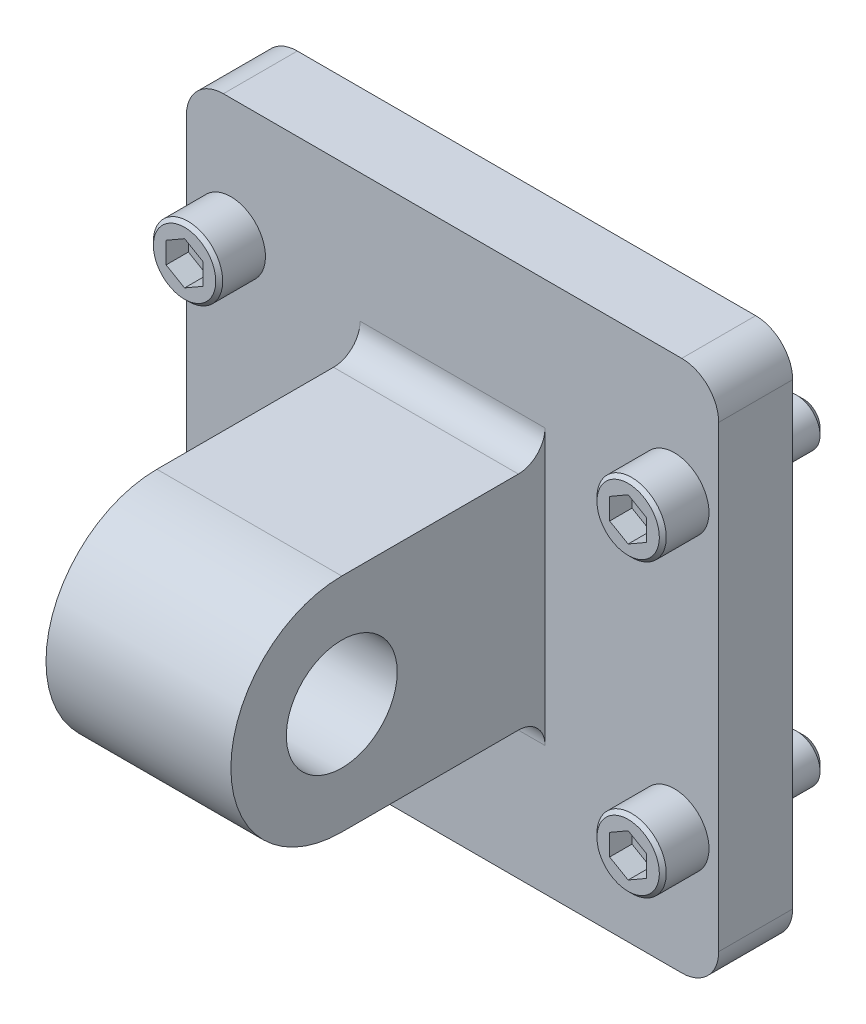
ISO-10303-21;
HEADER;
FILE_DESCRIPTION(('STEP AP214'),'2;1');
FILE_NAME('part.step','',(''),(''),'','','');
FILE_SCHEMA(('AUTOMOTIVE_DESIGN { 1 0 10303 214 1 1 1 1 }'));
ENDSEC;
DATA;
#1=APPLICATION_CONTEXT('core data for automotive mechanical design processes');
#2=APPLICATION_PROTOCOL_DEFINITION('international standard','automotive_design',2000,#1);
#3=PRODUCT_CONTEXT('',#1,'mechanical');
#4=PRODUCT('Part','Part','',(#3));
#5=PRODUCT_RELATED_PRODUCT_CATEGORY('part','',(#4));
#6=PRODUCT_DEFINITION_FORMATION('','',#4);
#7=PRODUCT_DEFINITION_CONTEXT('part definition',#1,'design');
#8=PRODUCT_DEFINITION('design','',#6,#7);
#9=PRODUCT_DEFINITION_SHAPE('','',#8);
#10=(LENGTH_UNIT() NAMED_UNIT(*) SI_UNIT(.MILLI.,.METRE.));
#11=(NAMED_UNIT(*) PLANE_ANGLE_UNIT() SI_UNIT($,.RADIAN.));
#12=(NAMED_UNIT(*) SI_UNIT($,.STERADIAN.) SOLID_ANGLE_UNIT());
#13=UNCERTAINTY_MEASURE_WITH_UNIT(LENGTH_MEASURE(1.E-05),#10,'distance_accuracy_value','');
#14=(GEOMETRIC_REPRESENTATION_CONTEXT(3) GLOBAL_UNCERTAINTY_ASSIGNED_CONTEXT((#13)) GLOBAL_UNIT_ASSIGNED_CONTEXT((#10,
#11,#12)) REPRESENTATION_CONTEXT('',''));
#15=CARTESIAN_POINT('',(0.,0.,0.));
#16=DIRECTION('',(0.,0.,1.));
#17=DIRECTION('',(1.,0.,0.));
#18=AXIS2_PLACEMENT_3D('',#15,#16,#17);
#19=CARTESIAN_POINT('',(34.9249999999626,30.5944613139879,16.8021));
#20=DIRECTION('',(0.,0.,-1.));
#21=DIRECTION('',(0.,1.,0.));
#22=AXIS2_PLACEMENT_3D('',#19,#20,#21);
#23=PLANE('',#22);
#24=DIRECTION('',(0.,-1.,0.));
#25=VECTOR('',#24,1.);
#26=CARTESIAN_POINT('',(34.9249999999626,26.9282871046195,16.8021));
#27=LINE('',#26,#25);
#28=CARTESIAN_POINT('',(34.9249999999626,26.9282871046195,16.8021));
#29=VERTEX_POINT('',#28);
#30=CARTESIAN_POINT('',(34.9249999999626,23.2621128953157,16.8021));
#31=VERTEX_POINT('',#30);
#32=EDGE_CURVE('E603',#29,#31,#27,.T.);
#33=ORIENTED_EDGE('',*,*,#32,.T.);
#34=DIRECTION('',(0.866025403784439,-0.5,0.));
#35=VECTOR('',#34,1.);
#36=CARTESIAN_POINT('',(34.9249999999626,23.2621128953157,16.8021));
#37=LINE('',#36,#35);
#38=CARTESIAN_POINT('',(38.1000000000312,21.429025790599,16.8021));
#39=VERTEX_POINT('',#38);
#40=EDGE_CURVE('E606',#31,#39,#37,.T.);
#41=ORIENTED_EDGE('',*,*,#40,.T.);
#42=DIRECTION('',(0.866025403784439,0.5,0.));
#43=VECTOR('',#42,1.);
#44=CARTESIAN_POINT('',(38.1000000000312,21.429025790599,16.8021));
#45=LINE('',#44,#43);
#46=CARTESIAN_POINT('',(41.2749999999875,23.2621128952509,16.8021));
#47=VERTEX_POINT('',#46);
#48=EDGE_CURVE('E609',#39,#47,#45,.T.);
#49=ORIENTED_EDGE('',*,*,#48,.T.);
#50=DIRECTION('',(0.,1.,0.));
#51=VECTOR('',#50,1.);
#52=CARTESIAN_POINT('',(41.2749999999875,23.2621128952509,16.8021));
#53=LINE('',#52,#51);
#54=CARTESIAN_POINT('',(41.2749999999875,26.9282871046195,16.8021));
#55=VERTEX_POINT('',#54);
#56=EDGE_CURVE('E612',#47,#55,#53,.T.);
#57=ORIENTED_EDGE('',*,*,#56,.T.);
#58=DIRECTION('',(-0.866025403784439,0.5,0.));
#59=VECTOR('',#58,1.);
#60=CARTESIAN_POINT('',(41.2749999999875,26.9282871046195,16.8021));
#61=LINE('',#60,#59);
#62=CARTESIAN_POINT('',(38.099999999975,28.7613742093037,16.8021));
#63=VERTEX_POINT('',#62);
#64=EDGE_CURVE('E615',#55,#63,#61,.T.);
#65=ORIENTED_EDGE('',*,*,#64,.T.);
#66=DIRECTION('',(-0.866025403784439,-0.5,0.));
#67=VECTOR('',#66,1.);
#68=CARTESIAN_POINT('',(38.099999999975,28.7613742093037,16.8021));
#69=LINE('',#68,#67);
#70=EDGE_CURVE('E618',#63,#29,#69,.T.);
#71=ORIENTED_EDGE('',*,*,#70,.T.);
#72=EDGE_LOOP('',(#33,#41,#49,#57,#65,#71));
#73=FACE_BOUND('',#72,.T.);
#74=ADVANCED_FACE('F14',(#73),#23,.F.);
#75=CARTESIAN_POINT('',(34.9249999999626,23.2621128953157,16.8021));
#76=DIRECTION('',(-0.5,-0.866025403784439,0.));
#77=DIRECTION('',(0.866025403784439,-0.5,0.));
#78=AXIS2_PLACEMENT_3D('',#75,#76,#77);
#79=PLANE('',#78);
#80=DIRECTION('',(0.866025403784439,-0.5,0.));
#81=VECTOR('',#80,1.);
#82=CARTESIAN_POINT('',(34.9249999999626,23.2621128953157,20.6375));
#83=LINE('',#82,#81);
#84=CARTESIAN_POINT('',(34.9249999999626,23.2621128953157,20.6375));
#85=VERTEX_POINT('',#84);
#86=CARTESIAN_POINT('',(38.1000000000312,21.429025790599,20.6375));
#87=VERTEX_POINT('',#86);
#88=EDGE_CURVE('E589',#85,#87,#83,.T.);
#89=ORIENTED_EDGE('',*,*,#88,.T.);
#90=DIRECTION('',(0.,0.,1.));
#91=VECTOR('',#90,1.);
#92=CARTESIAN_POINT('',(38.1000000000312,21.429025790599,16.8021));
#93=LINE('',#92,#91);
#94=EDGE_CURVE('E630',#39,#87,#93,.T.);
#95=ORIENTED_EDGE('',*,*,#94,.F.);
#96=ORIENTED_EDGE('',*,*,#40,.F.);
#97=DIRECTION('',(0.,0.,1.));
#98=VECTOR('',#97,1.);
#99=CARTESIAN_POINT('',(34.9249999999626,23.2621128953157,16.8021));
#100=LINE('',#99,#98);
#101=EDGE_CURVE('E621',#31,#85,#100,.T.);
#102=ORIENTED_EDGE('',*,*,#101,.T.);
#103=EDGE_LOOP('',(#89,#95,#96,#102));
#104=FACE_BOUND('',#103,.T.);
#105=ADVANCED_FACE('F881',(#104),#79,.F.);
#106=CARTESIAN_POINT('',(38.1000000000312,21.429025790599,16.8021));
#107=DIRECTION('',(0.5,-0.866025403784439,0.));
#108=DIRECTION('',(0.866025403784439,0.5,0.));
#109=AXIS2_PLACEMENT_3D('',#106,#107,#108);
#110=PLANE('',#109);
#111=DIRECTION('',(0.866025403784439,0.5,0.));
#112=VECTOR('',#111,1.);
#113=CARTESIAN_POINT('',(38.1000000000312,21.429025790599,20.6375));
#114=LINE('',#113,#112);
#115=CARTESIAN_POINT('',(41.2749999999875,23.2621128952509,20.6375));
#116=VERTEX_POINT('',#115);
#117=EDGE_CURVE('E592',#87,#116,#114,.T.);
#118=ORIENTED_EDGE('',*,*,#117,.T.);
#119=DIRECTION('',(0.,0.,1.));
#120=VECTOR('',#119,1.);
#121=CARTESIAN_POINT('',(41.2749999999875,23.2621128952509,16.8021));
#122=LINE('',#121,#120);
#123=EDGE_CURVE('E628',#47,#116,#122,.T.);
#124=ORIENTED_EDGE('',*,*,#123,.F.);
#125=ORIENTED_EDGE('',*,*,#48,.F.);
#126=ORIENTED_EDGE('',*,*,#94,.T.);
#127=EDGE_LOOP('',(#118,#124,#125,#126));
#128=FACE_BOUND('',#127,.T.);
#129=ADVANCED_FACE('F894',(#128),#110,.F.);
#130=CARTESIAN_POINT('',(41.2749999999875,23.2621128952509,16.8021));
#131=DIRECTION('',(1.,0.,0.));
#132=DIRECTION('',(0.,1.,0.));
#133=AXIS2_PLACEMENT_3D('',#130,#131,#132);
#134=PLANE('',#133);
#135=DIRECTION('',(0.,1.,0.));
#136=VECTOR('',#135,1.);
#137=CARTESIAN_POINT('',(41.2749999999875,23.2621128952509,20.6375));
#138=LINE('',#137,#136);
#139=CARTESIAN_POINT('',(41.2749999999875,26.9282871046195,20.6375));
#140=VERTEX_POINT('',#139);
#141=EDGE_CURVE('E595',#116,#140,#138,.T.);
#142=ORIENTED_EDGE('',*,*,#141,.T.);
#143=DIRECTION('',(0.,0.,1.));
#144=VECTOR('',#143,1.);
#145=CARTESIAN_POINT('',(41.2749999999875,26.9282871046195,16.8021));
#146=LINE('',#145,#144);
#147=EDGE_CURVE('E626',#55,#140,#146,.T.);
#148=ORIENTED_EDGE('',*,*,#147,.F.);
#149=ORIENTED_EDGE('',*,*,#56,.F.);
#150=ORIENTED_EDGE('',*,*,#123,.T.);
#151=EDGE_LOOP('',(#142,#148,#149,#150));
#152=FACE_BOUND('',#151,.T.);
#153=ADVANCED_FACE('F890',(#152),#134,.F.);
#154=CARTESIAN_POINT('',(41.2749999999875,26.9282871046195,16.8021));
#155=DIRECTION('',(0.5,0.866025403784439,0.));
#156=DIRECTION('',(-0.866025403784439,0.5,0.));
#157=AXIS2_PLACEMENT_3D('',#154,#155,#156);
#158=PLANE('',#157);
#159=DIRECTION('',(-0.866025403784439,0.5,0.));
#160=VECTOR('',#159,1.);
#161=CARTESIAN_POINT('',(41.2749999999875,26.9282871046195,20.6375));
#162=LINE('',#161,#160);
#163=CARTESIAN_POINT('',(38.099999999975,28.7613742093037,20.6375));
#164=VERTEX_POINT('',#163);
#165=EDGE_CURVE('E598',#140,#164,#162,.T.);
#166=ORIENTED_EDGE('',*,*,#165,.T.);
#167=DIRECTION('',(0.,0.,1.));
#168=VECTOR('',#167,1.);
#169=CARTESIAN_POINT('',(38.099999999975,28.7613742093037,16.8021));
#170=LINE('',#169,#168);
#171=EDGE_CURVE('E624',#63,#164,#170,.T.);
#172=ORIENTED_EDGE('',*,*,#171,.F.);
#173=ORIENTED_EDGE('',*,*,#64,.F.);
#174=ORIENTED_EDGE('',*,*,#147,.T.);
#175=EDGE_LOOP('',(#166,#172,#173,#174));
#176=FACE_BOUND('',#175,.T.);
#177=ADVANCED_FACE('F887',(#176),#158,.F.);
#178=CARTESIAN_POINT('',(38.099999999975,28.7613742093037,16.8021));
#179=DIRECTION('',(-0.5,0.866025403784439,0.));
#180=DIRECTION('',(-0.866025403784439,-0.5,0.));
#181=AXIS2_PLACEMENT_3D('',#178,#179,#180);
#182=PLANE('',#181);
#183=DIRECTION('',(-0.866025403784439,-0.5,0.));
#184=VECTOR('',#183,1.);
#185=CARTESIAN_POINT('',(38.099999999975,28.7613742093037,20.6375));
#186=LINE('',#185,#184);
#187=CARTESIAN_POINT('',(34.9249999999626,26.9282871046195,20.6375));
#188=VERTEX_POINT('',#187);
#189=EDGE_CURVE('E601',#164,#188,#186,.T.);
#190=ORIENTED_EDGE('',*,*,#189,.T.);
#191=DIRECTION('',(0.,0.,1.));
#192=VECTOR('',#191,1.);
#193=CARTESIAN_POINT('',(34.9249999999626,26.9282871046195,16.8021));
#194=LINE('',#193,#192);
#195=EDGE_CURVE('E37',#29,#188,#194,.T.);
#196=ORIENTED_EDGE('',*,*,#195,.F.);
#197=ORIENTED_EDGE('',*,*,#70,.F.);
#198=ORIENTED_EDGE('',*,*,#171,.T.);
#199=EDGE_LOOP('',(#190,#196,#197,#198));
#200=FACE_BOUND('',#199,.T.);
#201=ADVANCED_FACE('F883',(#200),#182,.F.);
#202=CARTESIAN_POINT('',(34.9249999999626,26.9282871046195,16.8021));
#203=DIRECTION('',(-1.,0.,0.));
#204=DIRECTION('',(0.,-1.,0.));
#205=AXIS2_PLACEMENT_3D('',#202,#203,#204);
#206=PLANE('',#205);
#207=DIRECTION('',(0.,-1.,0.));
#208=VECTOR('',#207,1.);
#209=CARTESIAN_POINT('',(34.9249999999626,26.9282871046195,20.6375));
#210=LINE('',#209,#208);
#211=EDGE_CURVE('E30',#188,#85,#210,.T.);
#212=ORIENTED_EDGE('',*,*,#211,.T.);
#213=ORIENTED_EDGE('',*,*,#101,.F.);
#214=ORIENTED_EDGE('',*,*,#32,.F.);
#215=ORIENTED_EDGE('',*,*,#195,.T.);
#216=EDGE_LOOP('',(#212,#213,#214,#215));
#217=FACE_BOUND('',#216,.T.);
#218=ADVANCED_FACE('F886',(#217),#206,.F.);
#219=CARTESIAN_POINT('',(43.458384,25.0952,20.6375));
#220=DIRECTION('',(0.,0.,1.));
#221=DIRECTION('',(0.,-1.,0.));
#222=AXIS2_PLACEMENT_3D('',#219,#220,#221);
#223=PLANE('',#222);
#224=ORIENTED_EDGE('',*,*,#211,.F.);
#225=ORIENTED_EDGE('',*,*,#189,.F.);
#226=ORIENTED_EDGE('',*,*,#165,.F.);
#227=ORIENTED_EDGE('',*,*,#141,.F.);
#228=ORIENTED_EDGE('',*,*,#117,.F.);
#229=ORIENTED_EDGE('',*,*,#88,.F.);
#230=EDGE_LOOP('',(#224,#225,#226,#227,#228,#229));
#231=FACE_BOUND('',#230,.T.);
#232=CARTESIAN_POINT('',(38.1,25.0952,20.6375));
#233=DIRECTION('',(0.,0.,-1.));
#234=DIRECTION('',(0.,1.,0.));
#235=AXIS2_PLACEMENT_3D('',#232,#233,#234);
#236=CIRCLE('',#235,5.358384);
#237=CARTESIAN_POINT('',(38.1,30.453584,20.6375));
#238=VERTEX_POINT('',#237);
#239=EDGE_CURVE('E638',#238,#238,#236,.T.);
#240=ORIENTED_EDGE('',*,*,#239,.F.);
#241=EDGE_LOOP('',(#240));
#242=FACE_BOUND('',#241,.T.);
#243=ADVANCED_FACE('F904',(#231,#242),#223,.T.);
#244=CARTESIAN_POINT('',(38.1,25.0952,20.042124));
#245=DIRECTION('',(0.,0.,-1.));
#246=DIRECTION('',(0.,1.,0.));
#247=AXIS2_PLACEMENT_3D('',#244,#245,#246);
#248=CONICAL_SURFACE('',#247,5.95376,0.785398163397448);
#249=ORIENTED_EDGE('',*,*,#239,.T.);
#250=EDGE_LOOP('',(#249));
#251=FACE_BOUND('',#250,.T.);
#252=CARTESIAN_POINT('',(38.1,25.0952,20.042124));
#253=DIRECTION('',(0.,0.,-1.));
#254=DIRECTION('',(0.,1.,0.));
#255=AXIS2_PLACEMENT_3D('',#252,#253,#254);
#256=CIRCLE('',#255,5.95376);
#257=CARTESIAN_POINT('',(38.1,31.04896,20.042124));
#258=VERTEX_POINT('',#257);
#259=EDGE_CURVE('E641',#258,#258,#256,.T.);
#260=ORIENTED_EDGE('',*,*,#259,.F.);
#261=EDGE_LOOP('',(#260));
#262=FACE_BOUND('',#261,.T.);
#263=ADVANCED_FACE('F916',(#251,#262),#248,.T.);
#264=CARTESIAN_POINT('',(38.1,25.0952,12.7));
#265=DIRECTION('',(0.,0.,-1.));
#266=DIRECTION('',(0.,1.,0.));
#267=AXIS2_PLACEMENT_3D('',#264,#265,#266);
#268=CYLINDRICAL_SURFACE('',#267,5.95376);
#269=ORIENTED_EDGE('',*,*,#259,.T.);
#270=EDGE_LOOP('',(#269));
#271=FACE_BOUND('',#270,.T.);
#272=CARTESIAN_POINT('',(38.1,25.0952,12.7));
#273=DIRECTION('',(0.,0.,-1.));
#274=DIRECTION('',(0.,1.,0.));
#275=AXIS2_PLACEMENT_3D('',#272,#273,#274);
#276=CIRCLE('',#275,5.95376);
#277=CARTESIAN_POINT('',(38.1,31.04896,12.7));
#278=VERTEX_POINT('',#277);
#279=EDGE_CURVE('E643',#278,#278,#276,.T.);
#280=ORIENTED_EDGE('',*,*,#279,.F.);
#281=EDGE_LOOP('',(#280));
#282=FACE_BOUND('',#281,.T.);
#283=ADVANCED_FACE('F656',(#271,#282),#268,.T.);
#284=CARTESIAN_POINT('',(38.1,25.0952,12.7));
#285=DIRECTION('',(0.,0.,-1.));
#286=DIRECTION('',(0.,1.,0.));
#287=AXIS2_PLACEMENT_3D('',#284,#285,#286);
#288=PLANE('',#287);
#289=CARTESIAN_POINT('',(38.1,25.0952,12.7));
#290=DIRECTION('',(0.,0.,-1.));
#291=DIRECTION('',(0.,1.,0.));
#292=AXIS2_PLACEMENT_3D('',#289,#290,#291);
#293=CIRCLE('',#292,3.96875);
#294=CARTESIAN_POINT('',(38.1,29.06395,12.7));
#295=VERTEX_POINT('',#294);
#296=EDGE_CURVE('E18',#295,#295,#293,.T.);
#297=ORIENTED_EDGE('',*,*,#296,.F.);
#298=EDGE_LOOP('',(#297));
#299=FACE_BOUND('',#298,.T.);
#300=CARTESIAN_POINT('',(38.1,25.0952,12.7));
#301=DIRECTION('',(0.,0.,-1.));
#302=DIRECTION('',(-1.,0.,0.));
#303=AXIS2_PLACEMENT_3D('',#300,#301,#302);
#304=CIRCLE('',#303,4.3688);
#305=CARTESIAN_POINT('',(33.7312,25.0952,12.7));
#306=VERTEX_POINT('',#305);
#307=EDGE_CURVE('E9',#306,#306,#304,.T.);
#308=ORIENTED_EDGE('',*,*,#307,.T.);
#309=EDGE_LOOP('',(#308));
#310=FACE_BOUND('',#309,.T.);
#311=ADVANCED_FACE('F16',(#299,#310),#288,.T.);
#312=CARTESIAN_POINT('',(38.1,25.0952,-9.525));
#313=DIRECTION('',(0.,0.,-1.));
#314=DIRECTION('',(0.,1.,0.));
#315=AXIS2_PLACEMENT_3D('',#312,#313,#314);
#316=PLANE('',#315);
#317=CARTESIAN_POINT('',(38.1,25.0952,-9.525));
#318=DIRECTION('',(0.,0.,-1.));
#319=DIRECTION('',(0.,1.,0.));
#320=AXIS2_PLACEMENT_3D('',#317,#318,#319);
#321=CIRCLE('',#320,2.79768935);
#322=CARTESIAN_POINT('',(38.1,27.89288935,-9.525));
#323=VERTEX_POINT('',#322);
#324=EDGE_CURVE('E635',#323,#323,#321,.T.);
#325=ORIENTED_EDGE('',*,*,#324,.T.);
#326=EDGE_LOOP('',(#325));
#327=FACE_BOUND('',#326,.T.);
#328=ADVANCED_FACE('F655',(#327),#316,.T.);
#329=CARTESIAN_POINT('',(38.1,25.0952,-9.525));
#330=DIRECTION('',(0.,0.,1.));
#331=DIRECTION('',(0.,-1.,0.));
#332=AXIS2_PLACEMENT_3D('',#329,#330,#331);
#333=CONICAL_SURFACE('',#332,2.79768935,0.78539816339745);
#334=CARTESIAN_POINT('',(38.1,25.0952,-8.35393935));
#335=DIRECTION('',(0.,0.,-1.));
#336=DIRECTION('',(0.,1.,0.));
#337=AXIS2_PLACEMENT_3D('',#334,#335,#336);
#338=CIRCLE('',#337,3.96875);
#339=CARTESIAN_POINT('',(38.1,29.06395,-8.35393935));
#340=VERTEX_POINT('',#339);
#341=EDGE_CURVE('E623',#340,#340,#338,.T.);
#342=ORIENTED_EDGE('',*,*,#341,.T.);
#343=EDGE_LOOP('',(#342));
#344=FACE_BOUND('',#343,.T.);
#345=ORIENTED_EDGE('',*,*,#324,.F.);
#346=EDGE_LOOP('',(#345));
#347=FACE_BOUND('',#346,.T.);
#348=ADVANCED_FACE('F907',(#344,#347),#333,.T.);
#349=CARTESIAN_POINT('',(38.1,25.0952,12.7));
#350=DIRECTION('',(0.,0.,-1.));
#351=DIRECTION('',(0.,1.,0.));
#352=AXIS2_PLACEMENT_3D('',#349,#350,#351);
#353=CYLINDRICAL_SURFACE('',#352,3.96875);
#354=ORIENTED_EDGE('',*,*,#296,.T.);
#355=EDGE_LOOP('',(#354));
#356=FACE_BOUND('',#355,.T.);
#357=ORIENTED_EDGE('',*,*,#341,.F.);
#358=EDGE_LOOP('',(#357));
#359=FACE_BOUND('',#358,.T.);
#360=ADVANCED_FACE('F650',(#356,#359),#353,.T.);
#361=CARTESIAN_POINT('',(38.1,-24.892,-9.525));
#362=DIRECTION('',(0.,0.,-1.));
#363=DIRECTION('',(0.,1.,0.));
#364=AXIS2_PLACEMENT_3D('',#361,#362,#363);
#365=PLANE('',#364);
#366=CARTESIAN_POINT('',(38.1,-24.892,-9.525));
#367=DIRECTION('',(0.,0.,-1.));
#368=DIRECTION('',(0.,1.,0.));
#369=AXIS2_PLACEMENT_3D('',#366,#367,#368);
#370=CIRCLE('',#369,2.79768935);
#371=CARTESIAN_POINT('',(38.1,-22.09431065,-9.525));
#372=VERTEX_POINT('',#371);
#373=EDGE_CURVE('E572',#372,#372,#370,.T.);
#374=ORIENTED_EDGE('',*,*,#373,.T.);
#375=EDGE_LOOP('',(#374));
#376=FACE_BOUND('',#375,.T.);
#377=ADVANCED_FACE('F772',(#376),#365,.T.);
#378=CARTESIAN_POINT('',(-38.1,25.0952,-9.525));
#379=DIRECTION('',(0.,0.,-1.));
#380=DIRECTION('',(0.,1.,0.));
#381=AXIS2_PLACEMENT_3D('',#378,#379,#380);
#382=PLANE('',#381);
#383=CARTESIAN_POINT('',(-38.1,25.0952,-9.525));
#384=DIRECTION('',(0.,0.,-1.));
#385=DIRECTION('',(0.,1.,0.));
#386=AXIS2_PLACEMENT_3D('',#383,#384,#385);
#387=CIRCLE('',#386,2.79768935);
#388=CARTESIAN_POINT('',(-38.1,27.89288935,-9.525));
#389=VERTEX_POINT('',#388);
#390=EDGE_CURVE('E436',#389,#389,#387,.T.);
#391=ORIENTED_EDGE('',*,*,#390,.T.);
#392=EDGE_LOOP('',(#391));
#393=FACE_BOUND('',#392,.T.);
#394=ADVANCED_FACE('F768',(#393),#382,.T.);
#395=CARTESIAN_POINT('',(-38.1,-24.892,-9.525));
#396=DIRECTION('',(0.,0.,-1.));
#397=DIRECTION('',(0.,1.,0.));
#398=AXIS2_PLACEMENT_3D('',#395,#396,#397);
#399=PLANE('',#398);
#400=CARTESIAN_POINT('',(-38.1,-24.892,-9.525));
#401=DIRECTION('',(0.,0.,-1.));
#402=DIRECTION('',(0.,1.,0.));
#403=AXIS2_PLACEMENT_3D('',#400,#401,#402);
#404=CIRCLE('',#403,2.79768935);
#405=CARTESIAN_POINT('',(-38.1,-22.09431065,-9.525));
#406=VERTEX_POINT('',#405);
#407=EDGE_CURVE('E505',#406,#406,#404,.T.);
#408=ORIENTED_EDGE('',*,*,#407,.T.);
#409=EDGE_LOOP('',(#408));
#410=FACE_BOUND('',#409,.T.);
#411=ADVANCED_FACE('F771',(#410),#399,.T.);
#412=CARTESIAN_POINT('',(38.1,-24.892,-9.525));
#413=DIRECTION('',(0.,0.,1.));
#414=DIRECTION('',(0.,-1.,0.));
#415=AXIS2_PLACEMENT_3D('',#412,#413,#414);
#416=CONICAL_SURFACE('',#415,2.79768935,0.78539816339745);
#417=CARTESIAN_POINT('',(38.1,-24.892,-8.35393935));
#418=DIRECTION('',(0.,0.,-1.));
#419=DIRECTION('',(0.,1.,0.));
#420=AXIS2_PLACEMENT_3D('',#417,#418,#419);
#421=CIRCLE('',#420,3.96875);
#422=CARTESIAN_POINT('',(38.1,-20.92325,-8.35393935));
#423=VERTEX_POINT('',#422);
#424=EDGE_CURVE('E559',#423,#423,#421,.T.);
#425=ORIENTED_EDGE('',*,*,#424,.T.);
#426=EDGE_LOOP('',(#425));
#427=FACE_BOUND('',#426,.T.);
#428=ORIENTED_EDGE('',*,*,#373,.F.);
#429=EDGE_LOOP('',(#428));
#430=FACE_BOUND('',#429,.T.);
#431=ADVANCED_FACE('F766',(#427,#430),#416,.T.);
#432=CARTESIAN_POINT('',(-38.1,25.0952,-9.525));
#433=DIRECTION('',(0.,0.,1.));
#434=DIRECTION('',(0.,-1.,0.));
#435=AXIS2_PLACEMENT_3D('',#432,#433,#434);
#436=CONICAL_SURFACE('',#435,2.79768935,0.78539816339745);
#437=CARTESIAN_POINT('',(-38.1,25.0952,-8.35393935));
#438=DIRECTION('',(0.,0.,-1.));
#439=DIRECTION('',(0.,1.,0.));
#440=AXIS2_PLACEMENT_3D('',#437,#438,#439);
#441=CIRCLE('',#440,3.96875);
#442=CARTESIAN_POINT('',(-38.1,29.06395,-8.35393935));
#443=VERTEX_POINT('',#442);
#444=EDGE_CURVE('E423',#443,#443,#441,.T.);
#445=ORIENTED_EDGE('',*,*,#444,.T.);
#446=EDGE_LOOP('',(#445));
#447=FACE_BOUND('',#446,.T.);
#448=ORIENTED_EDGE('',*,*,#390,.F.);
#449=EDGE_LOOP('',(#448));
#450=FACE_BOUND('',#449,.T.);
#451=ADVANCED_FACE('F763',(#447,#450),#436,.T.);
#452=CARTESIAN_POINT('',(-38.1,-24.892,-9.525));
#453=DIRECTION('',(0.,0.,1.));
#454=DIRECTION('',(0.,-1.,0.));
#455=AXIS2_PLACEMENT_3D('',#452,#453,#454);
#456=CONICAL_SURFACE('',#455,2.79768935,0.78539816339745);
#457=CARTESIAN_POINT('',(-38.1,-24.892,-8.35393935));
#458=DIRECTION('',(0.,0.,-1.));
#459=DIRECTION('',(0.,1.,0.));
#460=AXIS2_PLACEMENT_3D('',#457,#458,#459);
#461=CIRCLE('',#460,3.96875);
#462=CARTESIAN_POINT('',(-38.1,-20.92325,-8.35393935));
#463=VERTEX_POINT('',#462);
#464=EDGE_CURVE('E492',#463,#463,#461,.T.);
#465=ORIENTED_EDGE('',*,*,#464,.T.);
#466=EDGE_LOOP('',(#465));
#467=FACE_BOUND('',#466,.T.);
#468=ORIENTED_EDGE('',*,*,#407,.F.);
#469=EDGE_LOOP('',(#468));
#470=FACE_BOUND('',#469,.T.);
#471=ADVANCED_FACE('F729',(#467,#470),#456,.T.);
#472=CARTESIAN_POINT('',(-41.2750000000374,30.5944613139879,16.8021));
#473=DIRECTION('',(0.,0.,-1.));
#474=DIRECTION('',(0.,1.,0.));
#475=AXIS2_PLACEMENT_3D('',#472,#473,#474);
#476=PLANE('',#475);
#477=DIRECTION('',(0.,-1.,0.));
#478=VECTOR('',#477,1.);
#479=CARTESIAN_POINT('',(-41.2750000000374,26.9282871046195,16.8021));
#480=LINE('',#479,#478);
#481=CARTESIAN_POINT('',(-41.2750000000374,26.9282871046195,16.8021));
#482=VERTEX_POINT('',#481);
#483=CARTESIAN_POINT('',(-41.2750000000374,23.2621128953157,16.8021));
#484=VERTEX_POINT('',#483);
#485=EDGE_CURVE('E402',#482,#484,#480,.T.);
#486=ORIENTED_EDGE('',*,*,#485,.T.);
#487=DIRECTION('',(0.866025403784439,-0.5,0.));
#488=VECTOR('',#487,1.);
#489=CARTESIAN_POINT('',(-41.2750000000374,23.2621128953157,16.8021));
#490=LINE('',#489,#488);
#491=CARTESIAN_POINT('',(-38.0999999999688,21.429025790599,16.8021));
#492=VERTEX_POINT('',#491);
#493=EDGE_CURVE('E405',#484,#492,#490,.T.);
#494=ORIENTED_EDGE('',*,*,#493,.T.);
#495=DIRECTION('',(0.866025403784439,0.5,0.));
#496=VECTOR('',#495,1.);
#497=CARTESIAN_POINT('',(-38.0999999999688,21.429025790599,16.8021));
#498=LINE('',#497,#496);
#499=CARTESIAN_POINT('',(-34.9250000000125,23.2621128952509,16.8021));
#500=VERTEX_POINT('',#499);
#501=EDGE_CURVE('E408',#492,#500,#498,.T.);
#502=ORIENTED_EDGE('',*,*,#501,.T.);
#503=DIRECTION('',(0.,1.,0.));
#504=VECTOR('',#503,1.);
#505=CARTESIAN_POINT('',(-34.9250000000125,23.2621128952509,16.8021));
#506=LINE('',#505,#504);
#507=CARTESIAN_POINT('',(-34.9250000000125,26.9282871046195,16.8021));
#508=VERTEX_POINT('',#507);
#509=EDGE_CURVE('E411',#500,#508,#506,.T.);
#510=ORIENTED_EDGE('',*,*,#509,.T.);
#511=DIRECTION('',(-0.866025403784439,0.5,0.));
#512=VECTOR('',#511,1.);
#513=CARTESIAN_POINT('',(-34.9250000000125,26.9282871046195,16.8021));
#514=LINE('',#513,#512);
#515=CARTESIAN_POINT('',(-38.100000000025,28.7613742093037,16.8021));
#516=VERTEX_POINT('',#515);
#517=EDGE_CURVE('E414',#508,#516,#514,.T.);
#518=ORIENTED_EDGE('',*,*,#517,.T.);
#519=DIRECTION('',(-0.866025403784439,-0.5,0.));
#520=VECTOR('',#519,1.);
#521=CARTESIAN_POINT('',(-38.100000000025,28.7613742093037,16.8021));
#522=LINE('',#521,#520);
#523=EDGE_CURVE('E417',#516,#482,#522,.T.);
#524=ORIENTED_EDGE('',*,*,#523,.T.);
#525=EDGE_LOOP('',(#486,#494,#502,#510,#518,#524));
#526=FACE_BOUND('',#525,.T.);
#527=ADVANCED_FACE('F725',(#526),#476,.F.);
#528=CARTESIAN_POINT('',(-41.2750000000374,-19.392738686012,16.8021));
#529=DIRECTION('',(0.,0.,-1.));
#530=DIRECTION('',(0.,1.,0.));
#531=AXIS2_PLACEMENT_3D('',#528,#529,#530);
#532=PLANE('',#531);
#533=DIRECTION('',(0.,-1.,0.));
#534=VECTOR('',#533,1.);
#535=CARTESIAN_POINT('',(-41.2750000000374,-23.0589128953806,16.8021));
#536=LINE('',#535,#534);
#537=CARTESIAN_POINT('',(-41.2750000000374,-23.0589128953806,16.8021));
#538=VERTEX_POINT('',#537);
#539=CARTESIAN_POINT('',(-41.2750000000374,-26.7250871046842,16.8021));
#540=VERTEX_POINT('',#539);
#541=EDGE_CURVE('E471',#538,#540,#536,.T.);
#542=ORIENTED_EDGE('',*,*,#541,.T.);
#543=DIRECTION('',(0.866025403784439,-0.5,0.));
#544=VECTOR('',#543,1.);
#545=CARTESIAN_POINT('',(-41.2750000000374,-26.7250871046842,16.8021));
#546=LINE('',#545,#544);
#547=CARTESIAN_POINT('',(-38.0999999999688,-28.5581742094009,16.8021));
#548=VERTEX_POINT('',#547);
#549=EDGE_CURVE('E474',#540,#548,#546,.T.);
#550=ORIENTED_EDGE('',*,*,#549,.T.);
#551=DIRECTION('',(0.866025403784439,0.5,0.));
#552=VECTOR('',#551,1.);
#553=CARTESIAN_POINT('',(-38.0999999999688,-28.5581742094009,16.8021));
#554=LINE('',#553,#552);
#555=CARTESIAN_POINT('',(-34.9250000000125,-26.7250871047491,16.8021));
#556=VERTEX_POINT('',#555);
#557=EDGE_CURVE('E477',#548,#556,#554,.T.);
#558=ORIENTED_EDGE('',*,*,#557,.T.);
#559=DIRECTION('',(0.,1.,0.));
#560=VECTOR('',#559,1.);
#561=CARTESIAN_POINT('',(-34.9250000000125,-26.7250871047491,16.8021));
#562=LINE('',#561,#560);
#563=CARTESIAN_POINT('',(-34.9250000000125,-23.0589128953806,16.8021));
#564=VERTEX_POINT('',#563);
#565=EDGE_CURVE('E480',#556,#564,#562,.T.);
#566=ORIENTED_EDGE('',*,*,#565,.T.);
#567=DIRECTION('',(-0.866025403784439,0.5,0.));
#568=VECTOR('',#567,1.);
#569=CARTESIAN_POINT('',(-34.9250000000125,-23.0589128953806,16.8021));
#570=LINE('',#569,#568);
#571=CARTESIAN_POINT('',(-38.100000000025,-21.2258257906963,16.8021));
#572=VERTEX_POINT('',#571);
#573=EDGE_CURVE('E483',#564,#572,#570,.T.);
#574=ORIENTED_EDGE('',*,*,#573,.T.);
#575=DIRECTION('',(-0.866025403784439,-0.5,0.));
#576=VECTOR('',#575,1.);
#577=CARTESIAN_POINT('',(-38.100000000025,-21.2258257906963,16.8021));
#578=LINE('',#577,#576);
#579=EDGE_CURVE('E486',#572,#538,#578,.T.);
#580=ORIENTED_EDGE('',*,*,#579,.T.);
#581=EDGE_LOOP('',(#542,#550,#558,#566,#574,#580));
#582=FACE_BOUND('',#581,.T.);
#583=ADVANCED_FACE('F728',(#582),#532,.F.);
#584=CARTESIAN_POINT('',(34.9249999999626,-19.392738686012,16.8021));
#585=DIRECTION('',(0.,0.,-1.));
#586=DIRECTION('',(0.,1.,0.));
#587=AXIS2_PLACEMENT_3D('',#584,#585,#586);
#588=PLANE('',#587);
#589=DIRECTION('',(0.,-1.,0.));
#590=VECTOR('',#589,1.);
#591=CARTESIAN_POINT('',(34.9249999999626,-23.0589128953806,16.8021));
#592=LINE('',#591,#590);
#593=CARTESIAN_POINT('',(34.9249999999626,-23.0589128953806,16.8021));
#594=VERTEX_POINT('',#593);
#595=CARTESIAN_POINT('',(34.9249999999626,-26.7250871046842,16.8021));
#596=VERTEX_POINT('',#595);
#597=EDGE_CURVE('E538',#594,#596,#592,.T.);
#598=ORIENTED_EDGE('',*,*,#597,.T.);
#599=DIRECTION('',(0.866025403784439,-0.5,0.));
#600=VECTOR('',#599,1.);
#601=CARTESIAN_POINT('',(34.9249999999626,-26.7250871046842,16.8021));
#602=LINE('',#601,#600);
#603=CARTESIAN_POINT('',(38.1000000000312,-28.5581742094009,16.8021));
#604=VERTEX_POINT('',#603);
#605=EDGE_CURVE('E541',#596,#604,#602,.T.);
#606=ORIENTED_EDGE('',*,*,#605,.T.);
#607=DIRECTION('',(0.866025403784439,0.5,0.));
#608=VECTOR('',#607,1.);
#609=CARTESIAN_POINT('',(38.1000000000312,-28.5581742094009,16.8021));
#610=LINE('',#609,#608);
#611=CARTESIAN_POINT('',(41.2749999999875,-26.7250871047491,16.8021));
#612=VERTEX_POINT('',#611);
#613=EDGE_CURVE('E544',#604,#612,#610,.T.);
#614=ORIENTED_EDGE('',*,*,#613,.T.);
#615=DIRECTION('',(0.,1.,0.));
#616=VECTOR('',#615,1.);
#617=CARTESIAN_POINT('',(41.2749999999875,-26.7250871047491,16.8021));
#618=LINE('',#617,#616);
#619=CARTESIAN_POINT('',(41.2749999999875,-23.0589128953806,16.8021));
#620=VERTEX_POINT('',#619);
#621=EDGE_CURVE('E547',#612,#620,#618,.T.);
#622=ORIENTED_EDGE('',*,*,#621,.T.);
#623=DIRECTION('',(-0.866025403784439,0.5,0.));
#624=VECTOR('',#623,1.);
#625=CARTESIAN_POINT('',(41.2749999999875,-23.0589128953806,16.8021));
#626=LINE('',#625,#624);
#627=CARTESIAN_POINT('',(38.099999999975,-21.2258257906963,16.8021));
#628=VERTEX_POINT('',#627);
#629=EDGE_CURVE('E550',#620,#628,#626,.T.);
#630=ORIENTED_EDGE('',*,*,#629,.T.);
#631=DIRECTION('',(-0.866025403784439,-0.5,0.));
#632=VECTOR('',#631,1.);
#633=CARTESIAN_POINT('',(38.099999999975,-21.2258257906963,16.8021));
#634=LINE('',#633,#632);
#635=EDGE_CURVE('E553',#628,#594,#634,.T.);
#636=ORIENTED_EDGE('',*,*,#635,.T.);
#637=EDGE_LOOP('',(#598,#606,#614,#622,#630,#636));
#638=FACE_BOUND('',#637,.T.);
#639=ADVANCED_FACE('F788',(#638),#588,.F.);
#640=CARTESIAN_POINT('',(38.1,-24.892,12.7));
#641=DIRECTION('',(0.,0.,-1.));
#642=DIRECTION('',(0.,1.,0.));
#643=AXIS2_PLACEMENT_3D('',#640,#641,#642);
#644=CYLINDRICAL_SURFACE('',#643,3.96875);
#645=CARTESIAN_POINT('',(38.1,-24.892,12.7));
#646=DIRECTION('',(0.,0.,-1.));
#647=DIRECTION('',(0.,1.,0.));
#648=AXIS2_PLACEMENT_3D('',#645,#646,#647);
#649=CIRCLE('',#648,3.96875);
#650=CARTESIAN_POINT('',(38.1,-20.92325,12.7));
#651=VERTEX_POINT('',#650);
#652=EDGE_CURVE('E584',#651,#651,#649,.T.);
#653=ORIENTED_EDGE('',*,*,#652,.T.);
#654=EDGE_LOOP('',(#653));
#655=FACE_BOUND('',#654,.T.);
#656=ORIENTED_EDGE('',*,*,#424,.F.);
#657=EDGE_LOOP('',(#656));
#658=FACE_BOUND('',#657,.T.);
#659=ADVANCED_FACE('F761',(#655,#658),#644,.T.);
#660=CARTESIAN_POINT('',(-38.1,25.0952,12.7));
#661=DIRECTION('',(0.,0.,-1.));
#662=DIRECTION('',(0.,1.,0.));
#663=AXIS2_PLACEMENT_3D('',#660,#661,#662);
#664=CYLINDRICAL_SURFACE('',#663,3.96875);
#665=CARTESIAN_POINT('',(-38.1,25.0952,12.7));
#666=DIRECTION('',(0.,0.,-1.));
#667=DIRECTION('',(0.,1.,0.));
#668=AXIS2_PLACEMENT_3D('',#665,#666,#667);
#669=CIRCLE('',#668,3.96875);
#670=CARTESIAN_POINT('',(-38.1,29.06395,12.7));
#671=VERTEX_POINT('',#670);
#672=EDGE_CURVE('E448',#671,#671,#669,.T.);
#673=ORIENTED_EDGE('',*,*,#672,.T.);
#674=EDGE_LOOP('',(#673));
#675=FACE_BOUND('',#674,.T.);
#676=ORIENTED_EDGE('',*,*,#444,.F.);
#677=EDGE_LOOP('',(#676));
#678=FACE_BOUND('',#677,.T.);
#679=ADVANCED_FACE('F758',(#675,#678),#664,.T.);
#680=CARTESIAN_POINT('',(-38.1,-24.892,12.7));
#681=DIRECTION('',(0.,0.,-1.));
#682=DIRECTION('',(0.,1.,0.));
#683=AXIS2_PLACEMENT_3D('',#680,#681,#682);
#684=CYLINDRICAL_SURFACE('',#683,3.96875);
#685=CARTESIAN_POINT('',(-38.1,-24.892,12.7));
#686=DIRECTION('',(0.,0.,-1.));
#687=DIRECTION('',(0.,1.,0.));
#688=AXIS2_PLACEMENT_3D('',#685,#686,#687);
#689=CIRCLE('',#688,3.96875);
#690=CARTESIAN_POINT('',(-38.1,-20.92325,12.7));
#691=VERTEX_POINT('',#690);
#692=EDGE_CURVE('E517',#691,#691,#689,.T.);
#693=ORIENTED_EDGE('',*,*,#692,.T.);
#694=EDGE_LOOP('',(#693));
#695=FACE_BOUND('',#694,.T.);
#696=ORIENTED_EDGE('',*,*,#464,.F.);
#697=EDGE_LOOP('',(#696));
#698=FACE_BOUND('',#697,.T.);
#699=ADVANCED_FACE('F752',(#695,#698),#684,.T.);
#700=CARTESIAN_POINT('',(-41.2750000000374,23.2621128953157,16.8021));
#701=DIRECTION('',(-0.5,-0.866025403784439,0.));
#702=DIRECTION('',(0.866025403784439,-0.5,0.));
#703=AXIS2_PLACEMENT_3D('',#700,#701,#702);
#704=PLANE('',#703);
#705=DIRECTION('',(0.866025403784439,-0.5,0.));
#706=VECTOR('',#705,1.);
#707=CARTESIAN_POINT('',(-41.2750000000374,23.2621128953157,20.6375));
#708=LINE('',#707,#706);
#709=CARTESIAN_POINT('',(-41.2750000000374,23.2621128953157,20.6375));
#710=VERTEX_POINT('',#709);
#711=CARTESIAN_POINT('',(-38.0999999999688,21.429025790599,20.6375));
#712=VERTEX_POINT('',#711);
#713=EDGE_CURVE('E387',#710,#712,#708,.T.);
#714=ORIENTED_EDGE('',*,*,#713,.T.);
#715=DIRECTION('',(0.,0.,1.));
#716=VECTOR('',#715,1.);
#717=CARTESIAN_POINT('',(-38.0999999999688,21.429025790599,16.8021));
#718=LINE('',#717,#716);
#719=EDGE_CURVE('E430',#492,#712,#718,.T.);
#720=ORIENTED_EDGE('',*,*,#719,.F.);
#721=ORIENTED_EDGE('',*,*,#493,.F.);
#722=DIRECTION('',(0.,0.,1.));
#723=VECTOR('',#722,1.);
#724=CARTESIAN_POINT('',(-41.2750000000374,23.2621128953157,16.8021));
#725=LINE('',#724,#723);
#726=EDGE_CURVE('E420',#484,#710,#725,.T.);
#727=ORIENTED_EDGE('',*,*,#726,.T.);
#728=EDGE_LOOP('',(#714,#720,#721,#727));
#729=FACE_BOUND('',#728,.T.);
#730=ADVANCED_FACE('F731',(#729),#704,.F.);
#731=CARTESIAN_POINT('',(-38.0999999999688,21.429025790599,16.8021));
#732=DIRECTION('',(0.5,-0.866025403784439,0.));
#733=DIRECTION('',(0.866025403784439,0.5,0.));
#734=AXIS2_PLACEMENT_3D('',#731,#732,#733);
#735=PLANE('',#734);
#736=DIRECTION('',(0.866025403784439,0.5,0.));
#737=VECTOR('',#736,1.);
#738=CARTESIAN_POINT('',(-38.0999999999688,21.429025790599,20.6375));
#739=LINE('',#738,#737);
#740=CARTESIAN_POINT('',(-34.9250000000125,23.2621128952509,20.6375));
#741=VERTEX_POINT('',#740);
#742=EDGE_CURVE('E390',#712,#741,#739,.T.);
#743=ORIENTED_EDGE('',*,*,#742,.T.);
#744=DIRECTION('',(0.,0.,1.));
#745=VECTOR('',#744,1.);
#746=CARTESIAN_POINT('',(-34.9250000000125,23.2621128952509,16.8021));
#747=LINE('',#746,#745);
#748=EDGE_CURVE('E428',#500,#741,#747,.T.);
#749=ORIENTED_EDGE('',*,*,#748,.F.);
#750=ORIENTED_EDGE('',*,*,#501,.F.);
#751=ORIENTED_EDGE('',*,*,#719,.T.);
#752=EDGE_LOOP('',(#743,#749,#750,#751));
#753=FACE_BOUND('',#752,.T.);
#754=ADVANCED_FACE('F745',(#753),#735,.F.);
#755=CARTESIAN_POINT('',(-34.9250000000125,23.2621128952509,16.8021));
#756=DIRECTION('',(1.,0.,0.));
#757=DIRECTION('',(0.,1.,0.));
#758=AXIS2_PLACEMENT_3D('',#755,#756,#757);
#759=PLANE('',#758);
#760=DIRECTION('',(0.,1.,0.));
#761=VECTOR('',#760,1.);
#762=CARTESIAN_POINT('',(-34.9250000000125,23.2621128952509,20.6375));
#763=LINE('',#762,#761);
#764=CARTESIAN_POINT('',(-34.9250000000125,26.9282871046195,20.6375));
#765=VERTEX_POINT('',#764);
#766=EDGE_CURVE('E393',#741,#765,#763,.T.);
#767=ORIENTED_EDGE('',*,*,#766,.T.);
#768=DIRECTION('',(0.,0.,1.));
#769=VECTOR('',#768,1.);
#770=CARTESIAN_POINT('',(-34.9250000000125,26.9282871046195,16.8021));
#771=LINE('',#770,#769);
#772=EDGE_CURVE('E426',#508,#765,#771,.T.);
#773=ORIENTED_EDGE('',*,*,#772,.F.);
#774=ORIENTED_EDGE('',*,*,#509,.F.);
#775=ORIENTED_EDGE('',*,*,#748,.T.);
#776=EDGE_LOOP('',(#767,#773,#774,#775));
#777=FACE_BOUND('',#776,.T.);
#778=ADVANCED_FACE('F741',(#777),#759,.F.);
#779=CARTESIAN_POINT('',(-34.9250000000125,26.9282871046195,16.8021));
#780=DIRECTION('',(0.5,0.866025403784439,0.));
#781=DIRECTION('',(-0.866025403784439,0.5,0.));
#782=AXIS2_PLACEMENT_3D('',#779,#780,#781);
#783=PLANE('',#782);
#784=DIRECTION('',(-0.866025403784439,0.5,0.));
#785=VECTOR('',#784,1.);
#786=CARTESIAN_POINT('',(-34.9250000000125,26.9282871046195,20.6375));
#787=LINE('',#786,#785);
#788=CARTESIAN_POINT('',(-38.100000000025,28.7613742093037,20.6375));
#789=VERTEX_POINT('',#788);
#790=EDGE_CURVE('E396',#765,#789,#787,.T.);
#791=ORIENTED_EDGE('',*,*,#790,.T.);
#792=DIRECTION('',(0.,0.,1.));
#793=VECTOR('',#792,1.);
#794=CARTESIAN_POINT('',(-38.100000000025,28.7613742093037,16.8021));
#795=LINE('',#794,#793);
#796=EDGE_CURVE('E424',#516,#789,#795,.T.);
#797=ORIENTED_EDGE('',*,*,#796,.F.);
#798=ORIENTED_EDGE('',*,*,#517,.F.);
#799=ORIENTED_EDGE('',*,*,#772,.T.);
#800=EDGE_LOOP('',(#791,#797,#798,#799));
#801=FACE_BOUND('',#800,.T.);
#802=ADVANCED_FACE('F737',(#801),#783,.F.);
#803=CARTESIAN_POINT('',(-38.100000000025,28.7613742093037,16.8021));
#804=DIRECTION('',(-0.5,0.866025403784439,0.));
#805=DIRECTION('',(-0.866025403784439,-0.5,0.));
#806=AXIS2_PLACEMENT_3D('',#803,#804,#805);
#807=PLANE('',#806);
#808=DIRECTION('',(-0.866025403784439,-0.5,0.));
#809=VECTOR('',#808,1.);
#810=CARTESIAN_POINT('',(-38.100000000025,28.7613742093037,20.6375));
#811=LINE('',#810,#809);
#812=CARTESIAN_POINT('',(-41.2750000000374,26.9282871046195,20.6375));
#813=VERTEX_POINT('',#812);
#814=EDGE_CURVE('E399',#789,#813,#811,.T.);
#815=ORIENTED_EDGE('',*,*,#814,.T.);
#816=DIRECTION('',(0.,0.,1.));
#817=VECTOR('',#816,1.);
#818=CARTESIAN_POINT('',(-41.2750000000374,26.9282871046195,16.8021));
#819=LINE('',#818,#817);
#820=EDGE_CURVE('E421',#482,#813,#819,.T.);
#821=ORIENTED_EDGE('',*,*,#820,.F.);
#822=ORIENTED_EDGE('',*,*,#523,.F.);
#823=ORIENTED_EDGE('',*,*,#796,.T.);
#824=EDGE_LOOP('',(#815,#821,#822,#823));
#825=FACE_BOUND('',#824,.T.);
#826=ADVANCED_FACE('F733',(#825),#807,.F.);
#827=CARTESIAN_POINT('',(-41.2750000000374,26.9282871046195,16.8021));
#828=DIRECTION('',(-1.,0.,0.));
#829=DIRECTION('',(0.,-1.,0.));
#830=AXIS2_PLACEMENT_3D('',#827,#828,#829);
#831=PLANE('',#830);
#832=DIRECTION('',(0.,-1.,0.));
#833=VECTOR('',#832,1.);
#834=CARTESIAN_POINT('',(-41.2750000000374,26.9282871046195,20.6375));
#835=LINE('',#834,#833);
#836=EDGE_CURVE('E385',#813,#710,#835,.T.);
#837=ORIENTED_EDGE('',*,*,#836,.T.);
#838=ORIENTED_EDGE('',*,*,#726,.F.);
#839=ORIENTED_EDGE('',*,*,#485,.F.);
#840=ORIENTED_EDGE('',*,*,#820,.T.);
#841=EDGE_LOOP('',(#837,#838,#839,#840));
#842=FACE_BOUND('',#841,.T.);
#843=ADVANCED_FACE('F736',(#842),#831,.F.);
#844=CARTESIAN_POINT('',(-41.2750000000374,-26.7250871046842,16.8021));
#845=DIRECTION('',(-0.5,-0.866025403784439,0.));
#846=DIRECTION('',(0.866025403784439,-0.5,0.));
#847=AXIS2_PLACEMENT_3D('',#844,#845,#846);
#848=PLANE('',#847);
#849=DIRECTION('',(0.866025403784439,-0.5,0.));
#850=VECTOR('',#849,1.);
#851=CARTESIAN_POINT('',(-41.2750000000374,-26.7250871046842,20.6375));
#852=LINE('',#851,#850);
#853=CARTESIAN_POINT('',(-41.2750000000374,-26.7250871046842,20.6375));
#854=VERTEX_POINT('',#853);
#855=CARTESIAN_POINT('',(-38.0999999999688,-28.5581742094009,20.6375));
#856=VERTEX_POINT('',#855);
#857=EDGE_CURVE('E456',#854,#856,#852,.T.);
#858=ORIENTED_EDGE('',*,*,#857,.T.);
#859=DIRECTION('',(0.,0.,1.));
#860=VECTOR('',#859,1.);
#861=CARTESIAN_POINT('',(-38.0999999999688,-28.5581742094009,16.8021));
#862=LINE('',#861,#860);
#863=EDGE_CURVE('E499',#548,#856,#862,.T.);
#864=ORIENTED_EDGE('',*,*,#863,.F.);
#865=ORIENTED_EDGE('',*,*,#549,.F.);
#866=DIRECTION('',(0.,0.,1.));
#867=VECTOR('',#866,1.);
#868=CARTESIAN_POINT('',(-41.2750000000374,-26.7250871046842,16.8021));
#869=LINE('',#868,#867);
#870=EDGE_CURVE('E489',#540,#854,#869,.T.);
#871=ORIENTED_EDGE('',*,*,#870,.T.);
#872=EDGE_LOOP('',(#858,#864,#865,#871));
#873=FACE_BOUND('',#872,.T.);
#874=ADVANCED_FACE('F756',(#873),#848,.F.);
#875=CARTESIAN_POINT('',(-38.0999999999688,-28.5581742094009,16.8021));
#876=DIRECTION('',(0.5,-0.866025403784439,0.));
#877=DIRECTION('',(0.866025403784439,0.5,0.));
#878=AXIS2_PLACEMENT_3D('',#875,#876,#877);
#879=PLANE('',#878);
#880=DIRECTION('',(0.866025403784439,0.5,0.));
#881=VECTOR('',#880,1.);
#882=CARTESIAN_POINT('',(-38.0999999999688,-28.5581742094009,20.6375));
#883=LINE('',#882,#881);
#884=CARTESIAN_POINT('',(-34.9250000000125,-26.7250871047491,20.6375));
#885=VERTEX_POINT('',#884);
#886=EDGE_CURVE('E459',#856,#885,#883,.T.);
#887=ORIENTED_EDGE('',*,*,#886,.T.);
#888=DIRECTION('',(0.,0.,1.));
#889=VECTOR('',#888,1.);
#890=CARTESIAN_POINT('',(-34.9250000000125,-26.7250871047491,16.8021));
#891=LINE('',#890,#889);
#892=EDGE_CURVE('E497',#556,#885,#891,.T.);
#893=ORIENTED_EDGE('',*,*,#892,.F.);
#894=ORIENTED_EDGE('',*,*,#557,.F.);
#895=ORIENTED_EDGE('',*,*,#863,.T.);
#896=EDGE_LOOP('',(#887,#893,#894,#895));
#897=FACE_BOUND('',#896,.T.);
#898=ADVANCED_FACE('F802',(#897),#879,.F.);
#899=CARTESIAN_POINT('',(-34.9250000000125,-26.7250871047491,16.8021));
#900=DIRECTION('',(1.,0.,0.));
#901=DIRECTION('',(0.,1.,0.));
#902=AXIS2_PLACEMENT_3D('',#899,#900,#901);
#903=PLANE('',#902);
#904=DIRECTION('',(0.,1.,0.));
#905=VECTOR('',#904,1.);
#906=CARTESIAN_POINT('',(-34.9250000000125,-26.7250871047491,20.6375));
#907=LINE('',#906,#905);
#908=CARTESIAN_POINT('',(-34.9250000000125,-23.0589128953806,20.6375));
#909=VERTEX_POINT('',#908);
#910=EDGE_CURVE('E462',#885,#909,#907,.T.);
#911=ORIENTED_EDGE('',*,*,#910,.T.);
#912=DIRECTION('',(0.,0.,1.));
#913=VECTOR('',#912,1.);
#914=CARTESIAN_POINT('',(-34.9250000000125,-23.0589128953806,16.8021));
#915=LINE('',#914,#913);
#916=EDGE_CURVE('E495',#564,#909,#915,.T.);
#917=ORIENTED_EDGE('',*,*,#916,.F.);
#918=ORIENTED_EDGE('',*,*,#565,.F.);
#919=ORIENTED_EDGE('',*,*,#892,.T.);
#920=EDGE_LOOP('',(#911,#917,#918,#919));
#921=FACE_BOUND('',#920,.T.);
#922=ADVANCED_FACE('F798',(#921),#903,.F.);
#923=CARTESIAN_POINT('',(-34.9250000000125,-23.0589128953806,16.8021));
#924=DIRECTION('',(0.5,0.866025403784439,0.));
#925=DIRECTION('',(-0.866025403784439,0.5,0.));
#926=AXIS2_PLACEMENT_3D('',#923,#924,#925);
#927=PLANE('',#926);
#928=DIRECTION('',(-0.866025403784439,0.5,0.));
#929=VECTOR('',#928,1.);
#930=CARTESIAN_POINT('',(-34.9250000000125,-23.0589128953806,20.6375));
#931=LINE('',#930,#929);
#932=CARTESIAN_POINT('',(-38.100000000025,-21.2258257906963,20.6375));
#933=VERTEX_POINT('',#932);
#934=EDGE_CURVE('E465',#909,#933,#931,.T.);
#935=ORIENTED_EDGE('',*,*,#934,.T.);
#936=DIRECTION('',(0.,0.,1.));
#937=VECTOR('',#936,1.);
#938=CARTESIAN_POINT('',(-38.100000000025,-21.2258257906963,16.8021));
#939=LINE('',#938,#937);
#940=EDGE_CURVE('E493',#572,#933,#939,.T.);
#941=ORIENTED_EDGE('',*,*,#940,.F.);
#942=ORIENTED_EDGE('',*,*,#573,.F.);
#943=ORIENTED_EDGE('',*,*,#916,.T.);
#944=EDGE_LOOP('',(#935,#941,#942,#943));
#945=FACE_BOUND('',#944,.T.);
#946=ADVANCED_FACE('F794',(#945),#927,.F.);
#947=CARTESIAN_POINT('',(-38.100000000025,-21.2258257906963,16.8021));
#948=DIRECTION('',(-0.5,0.866025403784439,0.));
#949=DIRECTION('',(-0.866025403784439,-0.5,0.));
#950=AXIS2_PLACEMENT_3D('',#947,#948,#949);
#951=PLANE('',#950);
#952=DIRECTION('',(-0.866025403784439,-0.5,0.));
#953=VECTOR('',#952,1.);
#954=CARTESIAN_POINT('',(-38.100000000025,-21.2258257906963,20.6375));
#955=LINE('',#954,#953);
#956=CARTESIAN_POINT('',(-41.2750000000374,-23.0589128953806,20.6375));
#957=VERTEX_POINT('',#956);
#958=EDGE_CURVE('E468',#933,#957,#955,.T.);
#959=ORIENTED_EDGE('',*,*,#958,.T.);
#960=DIRECTION('',(0.,0.,1.));
#961=VECTOR('',#960,1.);
#962=CARTESIAN_POINT('',(-41.2750000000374,-23.0589128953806,16.8021));
#963=LINE('',#962,#961);
#964=EDGE_CURVE('E490',#538,#957,#963,.T.);
#965=ORIENTED_EDGE('',*,*,#964,.F.);
#966=ORIENTED_EDGE('',*,*,#579,.F.);
#967=ORIENTED_EDGE('',*,*,#940,.T.);
#968=EDGE_LOOP('',(#959,#965,#966,#967));
#969=FACE_BOUND('',#968,.T.);
#970=ADVANCED_FACE('F790',(#969),#951,.F.);
#971=CARTESIAN_POINT('',(-41.2750000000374,-23.0589128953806,16.8021));
#972=DIRECTION('',(-1.,0.,0.));
#973=DIRECTION('',(0.,-1.,0.));
#974=AXIS2_PLACEMENT_3D('',#971,#972,#973);
#975=PLANE('',#974);
#976=DIRECTION('',(0.,-1.,0.));
#977=VECTOR('',#976,1.);
#978=CARTESIAN_POINT('',(-41.2750000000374,-23.0589128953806,20.6375));
#979=LINE('',#978,#977);
#980=EDGE_CURVE('E454',#957,#854,#979,.T.);
#981=ORIENTED_EDGE('',*,*,#980,.T.);
#982=ORIENTED_EDGE('',*,*,#870,.F.);
#983=ORIENTED_EDGE('',*,*,#541,.F.);
#984=ORIENTED_EDGE('',*,*,#964,.T.);
#985=EDGE_LOOP('',(#981,#982,#983,#984));
#986=FACE_BOUND('',#985,.T.);
#987=ADVANCED_FACE('F793',(#986),#975,.F.);
#988=CARTESIAN_POINT('',(34.9249999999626,-26.7250871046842,16.8021));
#989=DIRECTION('',(-0.5,-0.866025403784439,0.));
#990=DIRECTION('',(0.866025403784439,-0.5,0.));
#991=AXIS2_PLACEMENT_3D('',#988,#989,#990);
#992=PLANE('',#991);
#993=DIRECTION('',(0.866025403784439,-0.5,0.));
#994=VECTOR('',#993,1.);
#995=CARTESIAN_POINT('',(34.9249999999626,-26.7250871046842,20.6375));
#996=LINE('',#995,#994);
#997=CARTESIAN_POINT('',(34.9249999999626,-26.7250871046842,20.6375));
#998=VERTEX_POINT('',#997);
#999=CARTESIAN_POINT('',(38.1000000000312,-28.5581742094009,20.6375));
#1000=VERTEX_POINT('',#999);
#1001=EDGE_CURVE('E523',#998,#1000,#996,.T.);
#1002=ORIENTED_EDGE('',*,*,#1001,.T.);
#1003=DIRECTION('',(0.,0.,1.));
#1004=VECTOR('',#1003,1.);
#1005=CARTESIAN_POINT('',(38.1000000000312,-28.5581742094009,16.8021));
#1006=LINE('',#1005,#1004);
#1007=EDGE_CURVE('E566',#604,#1000,#1006,.T.);
#1008=ORIENTED_EDGE('',*,*,#1007,.F.);
#1009=ORIENTED_EDGE('',*,*,#605,.F.);
#1010=DIRECTION('',(0.,0.,1.));
#1011=VECTOR('',#1010,1.);
#1012=CARTESIAN_POINT('',(34.9249999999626,-26.7250871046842,16.8021));
#1013=LINE('',#1012,#1011);
#1014=EDGE_CURVE('E556',#596,#998,#1013,.T.);
#1015=ORIENTED_EDGE('',*,*,#1014,.T.);
#1016=EDGE_LOOP('',(#1002,#1008,#1009,#1015));
#1017=FACE_BOUND('',#1016,.T.);
#1018=ADVANCED_FACE('F812',(#1017),#992,.F.);
#1019=CARTESIAN_POINT('',(38.1000000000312,-28.5581742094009,16.8021));
#1020=DIRECTION('',(0.5,-0.866025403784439,0.));
#1021=DIRECTION('',(0.866025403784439,0.5,0.));
#1022=AXIS2_PLACEMENT_3D('',#1019,#1020,#1021);
#1023=PLANE('',#1022);
#1024=DIRECTION('',(0.866025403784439,0.5,0.));
#1025=VECTOR('',#1024,1.);
#1026=CARTESIAN_POINT('',(38.1000000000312,-28.5581742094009,20.6375));
#1027=LINE('',#1026,#1025);
#1028=CARTESIAN_POINT('',(41.2749999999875,-26.7250871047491,20.6375));
#1029=VERTEX_POINT('',#1028);
#1030=EDGE_CURVE('E526',#1000,#1029,#1027,.T.);
#1031=ORIENTED_EDGE('',*,*,#1030,.T.);
#1032=DIRECTION('',(0.,0.,1.));
#1033=VECTOR('',#1032,1.);
#1034=CARTESIAN_POINT('',(41.2749999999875,-26.7250871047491,16.8021));
#1035=LINE('',#1034,#1033);
#1036=EDGE_CURVE('E564',#612,#1029,#1035,.T.);
#1037=ORIENTED_EDGE('',*,*,#1036,.F.);
#1038=ORIENTED_EDGE('',*,*,#613,.F.);
#1039=ORIENTED_EDGE('',*,*,#1007,.T.);
#1040=EDGE_LOOP('',(#1031,#1037,#1038,#1039));
#1041=FACE_BOUND('',#1040,.T.);
#1042=ADVANCED_FACE('F850',(#1041),#1023,.F.);
#1043=CARTESIAN_POINT('',(41.2749999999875,-26.7250871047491,16.8021));
#1044=DIRECTION('',(1.,0.,0.));
#1045=DIRECTION('',(0.,1.,0.));
#1046=AXIS2_PLACEMENT_3D('',#1043,#1044,#1045);
#1047=PLANE('',#1046);
#1048=DIRECTION('',(0.,1.,0.));
#1049=VECTOR('',#1048,1.);
#1050=CARTESIAN_POINT('',(41.2749999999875,-26.7250871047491,20.6375));
#1051=LINE('',#1050,#1049);
#1052=CARTESIAN_POINT('',(41.2749999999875,-23.0589128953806,20.6375));
#1053=VERTEX_POINT('',#1052);
#1054=EDGE_CURVE('E529',#1029,#1053,#1051,.T.);
#1055=ORIENTED_EDGE('',*,*,#1054,.T.);
#1056=DIRECTION('',(0.,0.,1.));
#1057=VECTOR('',#1056,1.);
#1058=CARTESIAN_POINT('',(41.2749999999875,-23.0589128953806,16.8021));
#1059=LINE('',#1058,#1057);
#1060=EDGE_CURVE('E562',#620,#1053,#1059,.T.);
#1061=ORIENTED_EDGE('',*,*,#1060,.F.);
#1062=ORIENTED_EDGE('',*,*,#621,.F.);
#1063=ORIENTED_EDGE('',*,*,#1036,.T.);
#1064=EDGE_LOOP('',(#1055,#1061,#1062,#1063));
#1065=FACE_BOUND('',#1064,.T.);
#1066=ADVANCED_FACE('F846',(#1065),#1047,.F.);
#1067=CARTESIAN_POINT('',(41.2749999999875,-23.0589128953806,16.8021));
#1068=DIRECTION('',(0.5,0.866025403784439,0.));
#1069=DIRECTION('',(-0.866025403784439,0.5,0.));
#1070=AXIS2_PLACEMENT_3D('',#1067,#1068,#1069);
#1071=PLANE('',#1070);
#1072=DIRECTION('',(-0.866025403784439,0.5,0.));
#1073=VECTOR('',#1072,1.);
#1074=CARTESIAN_POINT('',(41.2749999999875,-23.0589128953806,20.6375));
#1075=LINE('',#1074,#1073);
#1076=CARTESIAN_POINT('',(38.099999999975,-21.2258257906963,20.6375));
#1077=VERTEX_POINT('',#1076);
#1078=EDGE_CURVE('E532',#1053,#1077,#1075,.T.);
#1079=ORIENTED_EDGE('',*,*,#1078,.T.);
#1080=DIRECTION('',(0.,0.,1.));
#1081=VECTOR('',#1080,1.);
#1082=CARTESIAN_POINT('',(38.099999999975,-21.2258257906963,16.8021));
#1083=LINE('',#1082,#1081);
#1084=EDGE_CURVE('E560',#628,#1077,#1083,.T.);
#1085=ORIENTED_EDGE('',*,*,#1084,.F.);
#1086=ORIENTED_EDGE('',*,*,#629,.F.);
#1087=ORIENTED_EDGE('',*,*,#1060,.T.);
#1088=EDGE_LOOP('',(#1079,#1085,#1086,#1087));
#1089=FACE_BOUND('',#1088,.T.);
#1090=ADVANCED_FACE('F842',(#1089),#1071,.F.);
#1091=CARTESIAN_POINT('',(38.099999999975,-21.2258257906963,16.8021));
#1092=DIRECTION('',(-0.5,0.866025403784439,0.));
#1093=DIRECTION('',(-0.866025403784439,-0.5,0.));
#1094=AXIS2_PLACEMENT_3D('',#1091,#1092,#1093);
#1095=PLANE('',#1094);
#1096=DIRECTION('',(-0.866025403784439,-0.5,0.));
#1097=VECTOR('',#1096,1.);
#1098=CARTESIAN_POINT('',(38.099999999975,-21.2258257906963,20.6375));
#1099=LINE('',#1098,#1097);
#1100=CARTESIAN_POINT('',(34.9249999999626,-23.0589128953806,20.6375));
#1101=VERTEX_POINT('',#1100);
#1102=EDGE_CURVE('E535',#1077,#1101,#1099,.T.);
#1103=ORIENTED_EDGE('',*,*,#1102,.T.);
#1104=DIRECTION('',(0.,0.,1.));
#1105=VECTOR('',#1104,1.);
#1106=CARTESIAN_POINT('',(34.9249999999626,-23.0589128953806,16.8021));
#1107=LINE('',#1106,#1105);
#1108=EDGE_CURVE('E557',#594,#1101,#1107,.T.);
#1109=ORIENTED_EDGE('',*,*,#1108,.F.);
#1110=ORIENTED_EDGE('',*,*,#635,.F.);
#1111=ORIENTED_EDGE('',*,*,#1084,.T.);
#1112=EDGE_LOOP('',(#1103,#1109,#1110,#1111));
#1113=FACE_BOUND('',#1112,.T.);
#1114=ADVANCED_FACE('F838',(#1113),#1095,.F.);
#1115=CARTESIAN_POINT('',(34.9249999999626,-23.0589128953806,16.8021));
#1116=DIRECTION('',(-1.,0.,0.));
#1117=DIRECTION('',(0.,-1.,0.));
#1118=AXIS2_PLACEMENT_3D('',#1115,#1116,#1117);
#1119=PLANE('',#1118);
#1120=DIRECTION('',(0.,-1.,0.));
#1121=VECTOR('',#1120,1.);
#1122=CARTESIAN_POINT('',(34.9249999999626,-23.0589128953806,20.6375));
#1123=LINE('',#1122,#1121);
#1124=EDGE_CURVE('E521',#1101,#998,#1123,.T.);
#1125=ORIENTED_EDGE('',*,*,#1124,.T.);
#1126=ORIENTED_EDGE('',*,*,#1014,.F.);
#1127=ORIENTED_EDGE('',*,*,#597,.F.);
#1128=ORIENTED_EDGE('',*,*,#1108,.T.);
#1129=EDGE_LOOP('',(#1125,#1126,#1127,#1128));
#1130=FACE_BOUND('',#1129,.T.);
#1131=ADVANCED_FACE('F841',(#1130),#1119,.F.);
#1132=CARTESIAN_POINT('',(38.1,-24.892,12.7));
#1133=DIRECTION('',(0.,0.,-1.));
#1134=DIRECTION('',(0.,1.,0.));
#1135=AXIS2_PLACEMENT_3D('',#1132,#1133,#1134);
#1136=PLANE('',#1135);
#1137=ORIENTED_EDGE('',*,*,#652,.F.);
#1138=EDGE_LOOP('',(#1137));
#1139=FACE_BOUND('',#1138,.T.);
#1140=CARTESIAN_POINT('',(38.1,-24.892,12.7));
#1141=DIRECTION('',(0.,0.,-1.));
#1142=DIRECTION('',(-1.,0.,0.));
#1143=AXIS2_PLACEMENT_3D('',#1140,#1141,#1142);
#1144=CIRCLE('',#1143,4.3688);
#1145=CARTESIAN_POINT('',(33.7312,-24.892,12.7));
#1146=VERTEX_POINT('',#1145);
#1147=EDGE_CURVE('E587',#1146,#1146,#1144,.T.);
#1148=ORIENTED_EDGE('',*,*,#1147,.T.);
#1149=EDGE_LOOP('',(#1148));
#1150=FACE_BOUND('',#1149,.T.);
#1151=ADVANCED_FACE('F701',(#1139,#1150),#1136,.T.);
#1152=CARTESIAN_POINT('',(-38.1,25.0952,12.7));
#1153=DIRECTION('',(0.,0.,-1.));
#1154=DIRECTION('',(0.,1.,0.));
#1155=AXIS2_PLACEMENT_3D('',#1152,#1153,#1154);
#1156=PLANE('',#1155);
#1157=ORIENTED_EDGE('',*,*,#672,.F.);
#1158=EDGE_LOOP('',(#1157));
#1159=FACE_BOUND('',#1158,.T.);
#1160=CARTESIAN_POINT('',(-38.1,25.0952,12.7));
#1161=DIRECTION('',(0.,0.,-1.));
#1162=DIRECTION('',(0.,1.,0.));
#1163=AXIS2_PLACEMENT_3D('',#1160,#1161,#1162);
#1164=CIRCLE('',#1163,4.3688);
#1165=CARTESIAN_POINT('',(-38.1,29.464,12.7));
#1166=VERTEX_POINT('',#1165);
#1167=EDGE_CURVE('E451',#1166,#1166,#1164,.T.);
#1168=ORIENTED_EDGE('',*,*,#1167,.T.);
#1169=EDGE_LOOP('',(#1168));
#1170=FACE_BOUND('',#1169,.T.);
#1171=ADVANCED_FACE('F774',(#1159,#1170),#1156,.T.);
#1172=CARTESIAN_POINT('',(-38.1,-24.892,12.7));
#1173=DIRECTION('',(0.,0.,-1.));
#1174=DIRECTION('',(0.,1.,0.));
#1175=AXIS2_PLACEMENT_3D('',#1172,#1173,#1174);
#1176=PLANE('',#1175);
#1177=CARTESIAN_POINT('',(-38.1,-24.892,12.7));
#1178=DIRECTION('',(0.,0.,1.));
#1179=DIRECTION('',(1.,0.,0.));
#1180=AXIS2_PLACEMENT_3D('',#1177,#1178,#1179);
#1181=CIRCLE('',#1180,4.3688);
#1182=CARTESIAN_POINT('',(-33.7312,-24.892,12.7));
#1183=VERTEX_POINT('',#1182);
#1184=EDGE_CURVE('E520',#1183,#1183,#1181,.T.);
#1185=ORIENTED_EDGE('',*,*,#1184,.F.);
#1186=EDGE_LOOP('',(#1185));
#1187=FACE_BOUND('',#1186,.T.);
#1188=ORIENTED_EDGE('',*,*,#692,.F.);
#1189=EDGE_LOOP('',(#1188));
#1190=FACE_BOUND('',#1189,.T.);
#1191=ADVANCED_FACE('F777',(#1187,#1190),#1176,.T.);
#1192=CARTESIAN_POINT('',(-32.741616,25.0952,20.6375));
#1193=DIRECTION('',(0.,0.,1.));
#1194=DIRECTION('',(0.,-1.,0.));
#1195=AXIS2_PLACEMENT_3D('',#1192,#1193,#1194);
#1196=PLANE('',#1195);
#1197=ORIENTED_EDGE('',*,*,#836,.F.);
#1198=ORIENTED_EDGE('',*,*,#814,.F.);
#1199=ORIENTED_EDGE('',*,*,#790,.F.);
#1200=ORIENTED_EDGE('',*,*,#766,.F.);
#1201=ORIENTED_EDGE('',*,*,#742,.F.);
#1202=ORIENTED_EDGE('',*,*,#713,.F.);
#1203=EDGE_LOOP('',(#1197,#1198,#1199,#1200,#1201,#1202));
#1204=FACE_BOUND('',#1203,.T.);
#1205=CARTESIAN_POINT('',(-38.1,25.0952,20.6375));
#1206=DIRECTION('',(0.,0.,-1.));
#1207=DIRECTION('',(0.,1.,0.));
#1208=AXIS2_PLACEMENT_3D('',#1205,#1206,#1207);
#1209=CIRCLE('',#1208,5.358384);
#1210=CARTESIAN_POINT('',(-38.1,30.453584,20.6375));
#1211=VERTEX_POINT('',#1210);
#1212=EDGE_CURVE('E439',#1211,#1211,#1209,.T.);
#1213=ORIENTED_EDGE('',*,*,#1212,.F.);
#1214=EDGE_LOOP('',(#1213));
#1215=FACE_BOUND('',#1214,.T.);
#1216=ADVANCED_FACE('F676',(#1204,#1215),#1196,.T.);
#1217=CARTESIAN_POINT('',(-32.741616,-24.892,20.6375));
#1218=DIRECTION('',(0.,0.,1.));
#1219=DIRECTION('',(0.,-1.,0.));
#1220=AXIS2_PLACEMENT_3D('',#1217,#1218,#1219);
#1221=PLANE('',#1220);
#1222=ORIENTED_EDGE('',*,*,#980,.F.);
#1223=ORIENTED_EDGE('',*,*,#958,.F.);
#1224=ORIENTED_EDGE('',*,*,#934,.F.);
#1225=ORIENTED_EDGE('',*,*,#910,.F.);
#1226=ORIENTED_EDGE('',*,*,#886,.F.);
#1227=ORIENTED_EDGE('',*,*,#857,.F.);
#1228=EDGE_LOOP('',(#1222,#1223,#1224,#1225,#1226,#1227));
#1229=FACE_BOUND('',#1228,.T.);
#1230=CARTESIAN_POINT('',(-38.1,-24.892,20.6375));
#1231=DIRECTION('',(0.,0.,-1.));
#1232=DIRECTION('',(0.,1.,0.));
#1233=AXIS2_PLACEMENT_3D('',#1230,#1231,#1232);
#1234=CIRCLE('',#1233,5.358384);
#1235=CARTESIAN_POINT('',(-38.1,-19.533616,20.6375));
#1236=VERTEX_POINT('',#1235);
#1237=EDGE_CURVE('E508',#1236,#1236,#1234,.T.);
#1238=ORIENTED_EDGE('',*,*,#1237,.F.);
#1239=EDGE_LOOP('',(#1238));
#1240=FACE_BOUND('',#1239,.T.);
#1241=ADVANCED_FACE('F776',(#1229,#1240),#1221,.T.);
#1242=CARTESIAN_POINT('',(43.458384,-24.892,20.6375));
#1243=DIRECTION('',(0.,0.,1.));
#1244=DIRECTION('',(0.,-1.,0.));
#1245=AXIS2_PLACEMENT_3D('',#1242,#1243,#1244);
#1246=PLANE('',#1245);
#1247=ORIENTED_EDGE('',*,*,#1124,.F.);
#1248=ORIENTED_EDGE('',*,*,#1102,.F.);
#1249=ORIENTED_EDGE('',*,*,#1078,.F.);
#1250=ORIENTED_EDGE('',*,*,#1054,.F.);
#1251=ORIENTED_EDGE('',*,*,#1030,.F.);
#1252=ORIENTED_EDGE('',*,*,#1001,.F.);
#1253=EDGE_LOOP('',(#1247,#1248,#1249,#1250,#1251,#1252));
#1254=FACE_BOUND('',#1253,.T.);
#1255=CARTESIAN_POINT('',(38.1,-24.892,20.6375));
#1256=DIRECTION('',(0.,0.,-1.));
#1257=DIRECTION('',(0.,1.,0.));
#1258=AXIS2_PLACEMENT_3D('',#1255,#1256,#1257);
#1259=CIRCLE('',#1258,5.358384);
#1260=CARTESIAN_POINT('',(38.1,-19.533616,20.6375));
#1261=VERTEX_POINT('',#1260);
#1262=EDGE_CURVE('E575',#1261,#1261,#1259,.T.);
#1263=ORIENTED_EDGE('',*,*,#1262,.F.);
#1264=EDGE_LOOP('',(#1263));
#1265=FACE_BOUND('',#1264,.T.);
#1266=ADVANCED_FACE('F686',(#1254,#1265),#1246,.T.);
#1267=CARTESIAN_POINT('',(38.1,-24.892,0.));
#1268=DIRECTION('',(0.,0.,1.));
#1269=DIRECTION('',(1.,0.,0.));
#1270=AXIS2_PLACEMENT_3D('',#1267,#1268,#1269);
#1271=CYLINDRICAL_SURFACE('',#1270,4.3688);
#1272=CARTESIAN_POINT('',(38.1,-24.892,0.));
#1273=DIRECTION('',(0.,0.,-1.));
#1274=DIRECTION('',(-1.,0.,0.));
#1275=AXIS2_PLACEMENT_3D('',#1272,#1273,#1274);
#1276=CIRCLE('',#1275,4.3688);
#1277=CARTESIAN_POINT('',(33.7312,-24.892,0.));
#1278=VERTEX_POINT('',#1277);
#1279=EDGE_CURVE('E1618',#1278,#1278,#1276,.T.);
#1280=ORIENTED_EDGE('',*,*,#1279,.T.);
#1281=EDGE_LOOP('',(#1280));
#1282=FACE_BOUND('',#1281,.T.);
#1283=ORIENTED_EDGE('',*,*,#1147,.F.);
#1284=EDGE_LOOP('',(#1283));
#1285=FACE_BOUND('',#1284,.T.);
#1286=ADVANCED_FACE('F665',(#1282,#1285),#1271,.F.);
#1287=CARTESIAN_POINT('',(-38.1,25.0952,0.));
#1288=DIRECTION('',(0.,0.,1.));
#1289=DIRECTION('',(1.,0.,0.));
#1290=AXIS2_PLACEMENT_3D('',#1287,#1288,#1289);
#1291=CYLINDRICAL_SURFACE('',#1290,4.3688);
#1292=CARTESIAN_POINT('',(-38.1,25.0952,0.));
#1293=DIRECTION('',(0.,0.,1.));
#1294=DIRECTION('',(1.,0.,0.));
#1295=AXIS2_PLACEMENT_3D('',#1292,#1293,#1294);
#1296=CIRCLE('',#1295,4.3688);
#1297=CARTESIAN_POINT('',(-33.7312,25.0952,0.));
#1298=VERTEX_POINT('',#1297);
#1299=EDGE_CURVE('E1629',#1298,#1298,#1296,.T.);
#1300=ORIENTED_EDGE('',*,*,#1299,.F.);
#1301=EDGE_LOOP('',(#1300));
#1302=FACE_BOUND('',#1301,.T.);
#1303=ORIENTED_EDGE('',*,*,#1167,.F.);
#1304=EDGE_LOOP('',(#1303));
#1305=FACE_BOUND('',#1304,.T.);
#1306=ADVANCED_FACE('F685',(#1302,#1305),#1291,.F.);
#1307=CARTESIAN_POINT('',(-38.1,-24.892,0.));
#1308=DIRECTION('',(0.,0.,1.));
#1309=DIRECTION('',(1.,0.,0.));
#1310=AXIS2_PLACEMENT_3D('',#1307,#1308,#1309);
#1311=CYLINDRICAL_SURFACE('',#1310,4.3688);
#1312=CARTESIAN_POINT('',(-38.1,-24.892,0.));
#1313=DIRECTION('',(0.,0.,1.));
#1314=DIRECTION('',(1.,0.,0.));
#1315=AXIS2_PLACEMENT_3D('',#1312,#1313,#1314);
#1316=CIRCLE('',#1315,4.3688);
#1317=CARTESIAN_POINT('',(-33.7312,-24.892,0.));
#1318=VERTEX_POINT('',#1317);
#1319=EDGE_CURVE('E1621',#1318,#1318,#1316,.T.);
#1320=ORIENTED_EDGE('',*,*,#1319,.F.);
#1321=EDGE_LOOP('',(#1320));
#1322=FACE_BOUND('',#1321,.T.);
#1323=ORIENTED_EDGE('',*,*,#1184,.T.);
#1324=EDGE_LOOP('',(#1323));
#1325=FACE_BOUND('',#1324,.T.);
#1326=ADVANCED_FACE('F666',(#1322,#1325),#1311,.F.);
#1327=CARTESIAN_POINT('',(15.88008,0.,47.6123));
#1328=DIRECTION('',(-1.,0.,0.));
#1329=DIRECTION('',(0.,0.,1.));
#1330=AXIS2_PLACEMENT_3D('',#1327,#1328,#1329);
#1331=CYLINDRICAL_SURFACE('',#1330,9.525);
#1332=CARTESIAN_POINT('',(15.88008,0.,47.6123));
#1333=DIRECTION('',(1.,0.,0.));
#1334=DIRECTION('',(0.,0.,-1.));
#1335=AXIS2_PLACEMENT_3D('',#1332,#1333,#1334);
#1336=CIRCLE('',#1335,9.525);
#1337=CARTESIAN_POINT('',(15.88008,0.,38.0873));
#1338=VERTEX_POINT('',#1337);
#1339=EDGE_CURVE('E288',#1338,#1338,#1336,.T.);
#1340=ORIENTED_EDGE('',*,*,#1339,.T.);
#1341=EDGE_LOOP('',(#1340));
#1342=FACE_BOUND('',#1341,.T.);
#1343=CARTESIAN_POINT('',(-15.88008,0.,47.6123));
#1344=DIRECTION('',(1.,0.,0.));
#1345=DIRECTION('',(0.,0.,-1.));
#1346=AXIS2_PLACEMENT_3D('',#1343,#1344,#1345);
#1347=CIRCLE('',#1346,9.525);
#1348=CARTESIAN_POINT('',(-15.88008,0.,38.0873));
#1349=VERTEX_POINT('',#1348);
#1350=EDGE_CURVE('E291',#1349,#1349,#1347,.T.);
#1351=ORIENTED_EDGE('',*,*,#1350,.F.);
#1352=EDGE_LOOP('',(#1351));
#1353=FACE_BOUND('',#1352,.T.);
#1354=ADVANCED_FACE('F690',(#1342,#1353),#1331,.F.);
#1355=CARTESIAN_POINT('',(15.88008,19.05,47.6123));
#1356=DIRECTION('',(0.,-1.,0.));
#1357=DIRECTION('',(0.,0.,-1.));
#1358=AXIS2_PLACEMENT_3D('',#1355,#1356,#1357);
#1359=PLANE('',#1358);
#1360=DIRECTION('',(0.,0.,1.));
#1361=VECTOR('',#1360,1.);
#1362=CARTESIAN_POINT('',(15.88008,19.05,47.6123));
#1363=LINE('',#1362,#1361);
#1364=CARTESIAN_POINT('',(15.88008,19.05,17.272));
#1365=VERTEX_POINT('',#1364);
#1366=CARTESIAN_POINT('',(15.88008,19.05,47.6123));
#1367=VERTEX_POINT('',#1366);
#1368=EDGE_CURVE('E303',#1365,#1367,#1363,.T.);
#1369=ORIENTED_EDGE('',*,*,#1368,.F.);
#1370=DIRECTION('',(-1.,0.,0.));
#1371=VECTOR('',#1370,1.);
#1372=CARTESIAN_POINT('',(15.88008,19.05,17.272));
#1373=LINE('',#1372,#1371);
#1374=CARTESIAN_POINT('',(-15.88008,19.05,17.272));
#1375=VERTEX_POINT('',#1374);
#1376=EDGE_CURVE('E373',#1365,#1375,#1373,.T.);
#1377=ORIENTED_EDGE('',*,*,#1376,.T.);
#1378=DIRECTION('',(0.,0.,1.));
#1379=VECTOR('',#1378,1.);
#1380=CARTESIAN_POINT('',(-15.88008,19.05,47.6123));
#1381=LINE('',#1380,#1379);
#1382=CARTESIAN_POINT('',(-15.88008,19.05,47.6123));
#1383=VERTEX_POINT('',#1382);
#1384=EDGE_CURVE('E296',#1375,#1383,#1381,.T.);
#1385=ORIENTED_EDGE('',*,*,#1384,.T.);
#1386=DIRECTION('',(-1.,0.,0.));
#1387=VECTOR('',#1386,1.);
#1388=CARTESIAN_POINT('',(15.88008,19.05,47.6123));
#1389=LINE('',#1388,#1387);
#1390=EDGE_CURVE('E283',#1367,#1383,#1389,.T.);
#1391=ORIENTED_EDGE('',*,*,#1390,.F.);
#1392=EDGE_LOOP('',(#1369,#1377,#1385,#1391));
#1393=FACE_BOUND('',#1392,.T.);
#1394=ADVANCED_FACE('F1113',(#1393),#1359,.F.);
#1395=CARTESIAN_POINT('',(15.88008,0.,47.6123));
#1396=DIRECTION('',(-1.,0.,0.));
#1397=DIRECTION('',(0.,0.,1.));
#1398=AXIS2_PLACEMENT_3D('',#1395,#1396,#1397);
#1399=CYLINDRICAL_SURFACE('',#1398,19.05);
#1400=CARTESIAN_POINT('',(-15.88008,0.,47.6123));
#1401=DIRECTION('',(1.,0.,0.));
#1402=DIRECTION('',(0.,0.,-1.));
#1403=AXIS2_PLACEMENT_3D('',#1400,#1401,#1402);
#1404=CIRCLE('',#1403,19.05);
#1405=CARTESIAN_POINT('',(-15.88008,-19.05,47.6123));
#1406=VERTEX_POINT('',#1405);
#1407=EDGE_CURVE('E267',#1383,#1406,#1404,.T.);
#1408=ORIENTED_EDGE('',*,*,#1407,.T.);
#1409=DIRECTION('',(-1.,0.,0.));
#1410=VECTOR('',#1409,1.);
#1411=CARTESIAN_POINT('',(15.88008,-19.05,47.6123));
#1412=LINE('',#1411,#1410);
#1413=CARTESIAN_POINT('',(15.88008,-19.05,47.6123));
#1414=VERTEX_POINT('',#1413);
#1415=EDGE_CURVE('E275',#1414,#1406,#1412,.T.);
#1416=ORIENTED_EDGE('',*,*,#1415,.F.);
#1417=CARTESIAN_POINT('',(15.88008,0.,47.6123));
#1418=DIRECTION('',(1.,0.,0.));
#1419=DIRECTION('',(0.,0.,-1.));
#1420=AXIS2_PLACEMENT_3D('',#1417,#1418,#1419);
#1421=CIRCLE('',#1420,19.05);
#1422=EDGE_CURVE('E298',#1367,#1414,#1421,.T.);
#1423=ORIENTED_EDGE('',*,*,#1422,.F.);
#1424=ORIENTED_EDGE('',*,*,#1390,.T.);
#1425=EDGE_LOOP('',(#1408,#1416,#1423,#1424));
#1426=FACE_BOUND('',#1425,.T.);
#1427=ADVANCED_FACE('F286',(#1426),#1399,.T.);
#1428=CARTESIAN_POINT('',(15.88008,-19.05,47.6123));
#1429=DIRECTION('',(0.,1.,0.));
#1430=DIRECTION('',(0.,0.,1.));
#1431=AXIS2_PLACEMENT_3D('',#1428,#1429,#1430);
#1432=PLANE('',#1431);
#1433=DIRECTION('',(0.,0.,-1.));
#1434=VECTOR('',#1433,1.);
#1435=CARTESIAN_POINT('',(-15.88008,-19.05,47.6123));
#1436=LINE('',#1435,#1434);
#1437=CARTESIAN_POINT('',(-15.88008,-19.05,17.272));
#1438=VERTEX_POINT('',#1437);
#1439=EDGE_CURVE('E261',#1406,#1438,#1436,.T.);
#1440=ORIENTED_EDGE('',*,*,#1439,.T.);
#1441=DIRECTION('',(-1.,0.,0.));
#1442=VECTOR('',#1441,1.);
#1443=CARTESIAN_POINT('',(15.88008,-19.05,17.272));
#1444=LINE('',#1443,#1442);
#1445=CARTESIAN_POINT('',(15.88008,-19.05,17.272));
#1446=VERTEX_POINT('',#1445);
#1447=EDGE_CURVE('E371',#1438,#1446,#1444,.F.);
#1448=ORIENTED_EDGE('',*,*,#1447,.T.);
#1449=DIRECTION('',(0.,0.,-1.));
#1450=VECTOR('',#1449,1.);
#1451=CARTESIAN_POINT('',(15.88008,-19.05,47.6123));
#1452=LINE('',#1451,#1450);
#1453=EDGE_CURVE('E278',#1414,#1446,#1452,.T.);
#1454=ORIENTED_EDGE('',*,*,#1453,.F.);
#1455=ORIENTED_EDGE('',*,*,#1415,.T.);
#1456=EDGE_LOOP('',(#1440,#1448,#1454,#1455));
#1457=FACE_BOUND('',#1456,.T.);
#1458=ADVANCED_FACE('F276',(#1457),#1432,.F.);
#1459=CARTESIAN_POINT('',(-45.72,-45.72,0.));
#1460=DIRECTION('',(0.,0.,1.));
#1461=DIRECTION('',(1.,0.,0.));
#1462=AXIS2_PLACEMENT_3D('',#1459,#1460,#1461);
#1463=PLANE('',#1462);
#1464=CARTESIAN_POINT('',(38.1,25.0952,0.));
#1465=DIRECTION('',(0.,0.,-1.));
#1466=DIRECTION('',(-1.,0.,0.));
#1467=AXIS2_PLACEMENT_3D('',#1464,#1465,#1466);
#1468=CIRCLE('',#1467,4.3688);
#1469=CARTESIAN_POINT('',(33.7312,25.0952,0.));
#1470=VERTEX_POINT('',#1469);
#1471=EDGE_CURVE('E1619',#1470,#1470,#1468,.T.);
#1472=ORIENTED_EDGE('',*,*,#1471,.F.);
#1473=EDGE_LOOP('',(#1472));
#1474=FACE_BOUND('',#1473,.T.);
#1475=ORIENTED_EDGE('',*,*,#1319,.T.);
#1476=EDGE_LOOP('',(#1475));
#1477=FACE_BOUND('',#1476,.T.);
#1478=ORIENTED_EDGE('',*,*,#1299,.T.);
#1479=EDGE_LOOP('',(#1478));
#1480=FACE_BOUND('',#1479,.T.);
#1481=DIRECTION('',(1.,0.,0.));
#1482=VECTOR('',#1481,1.);
#1483=CARTESIAN_POINT('',(-45.72,-45.72,0.));
#1484=LINE('',#1483,#1482);
#1485=CARTESIAN_POINT('',(-39.37,-45.72,0.));
#1486=VERTEX_POINT('',#1485);
#1487=CARTESIAN_POINT('',(39.37,-45.72,0.));
#1488=VERTEX_POINT('',#1487);
#1489=EDGE_CURVE('E308',#1486,#1488,#1484,.T.);
#1490=ORIENTED_EDGE('',*,*,#1489,.F.);
#1491=CARTESIAN_POINT('',(-39.37,-39.37,0.));
#1492=DIRECTION('',(0.,0.,1.));
#1493=DIRECTION('',(1.,0.,0.));
#1494=AXIS2_PLACEMENT_3D('',#1491,#1492,#1493);
#1495=CIRCLE('',#1494,6.35);
#1496=CARTESIAN_POINT('',(-45.72,-39.37,0.));
#1497=VERTEX_POINT('',#1496);
#1498=EDGE_CURVE('E340',#1486,#1497,#1495,.F.);
#1499=ORIENTED_EDGE('',*,*,#1498,.T.);
#1500=DIRECTION('',(0.,-1.,0.));
#1501=VECTOR('',#1500,1.);
#1502=CARTESIAN_POINT('',(-45.72,45.72,0.));
#1503=LINE('',#1502,#1501);
#1504=CARTESIAN_POINT('',(-45.72,39.37,0.));
#1505=VERTEX_POINT('',#1504);
#1506=EDGE_CURVE('E282',#1505,#1497,#1503,.T.);
#1507=ORIENTED_EDGE('',*,*,#1506,.F.);
#1508=CARTESIAN_POINT('',(-39.37,39.37,0.));
#1509=DIRECTION('',(0.,0.,1.));
#1510=DIRECTION('',(1.,0.,0.));
#1511=AXIS2_PLACEMENT_3D('',#1508,#1509,#1510);
#1512=CIRCLE('',#1511,6.35);
#1513=CARTESIAN_POINT('',(-39.37,45.72,0.));
#1514=VERTEX_POINT('',#1513);
#1515=EDGE_CURVE('E334',#1505,#1514,#1512,.F.);
#1516=ORIENTED_EDGE('',*,*,#1515,.T.);
#1517=DIRECTION('',(-1.,0.,0.));
#1518=VECTOR('',#1517,1.);
#1519=CARTESIAN_POINT('',(-45.72,45.72,0.));
#1520=LINE('',#1519,#1518);
#1521=CARTESIAN_POINT('',(39.37,45.72,0.));
#1522=VERTEX_POINT('',#1521);
#1523=EDGE_CURVE('E314',#1522,#1514,#1520,.T.);
#1524=ORIENTED_EDGE('',*,*,#1523,.F.);
#1525=CARTESIAN_POINT('',(39.37,39.37,0.));
#1526=DIRECTION('',(0.,0.,1.));
#1527=DIRECTION('',(1.,0.,0.));
#1528=AXIS2_PLACEMENT_3D('',#1525,#1526,#1527);
#1529=CIRCLE('',#1528,6.35);
#1530=CARTESIAN_POINT('',(45.72,39.37,0.));
#1531=VERTEX_POINT('',#1530);
#1532=EDGE_CURVE('E336',#1522,#1531,#1529,.F.);
#1533=ORIENTED_EDGE('',*,*,#1532,.T.);
#1534=DIRECTION('',(0.,1.,0.));
#1535=VECTOR('',#1534,1.);
#1536=CARTESIAN_POINT('',(45.72,45.72,0.));
#1537=LINE('',#1536,#1535);
#1538=CARTESIAN_POINT('',(45.72,-39.37,0.));
#1539=VERTEX_POINT('',#1538);
#1540=EDGE_CURVE('E311',#1539,#1531,#1537,.T.);
#1541=ORIENTED_EDGE('',*,*,#1540,.F.);
#1542=CARTESIAN_POINT('',(39.37,-39.37,0.));
#1543=DIRECTION('',(0.,0.,1.));
#1544=DIRECTION('',(1.,0.,0.));
#1545=AXIS2_PLACEMENT_3D('',#1542,#1543,#1544);
#1546=CIRCLE('',#1545,6.35);
#1547=EDGE_CURVE('E338',#1539,#1488,#1546,.F.);
#1548=ORIENTED_EDGE('',*,*,#1547,.T.);
#1549=EDGE_LOOP('',(#1490,#1499,#1507,#1516,#1524,#1533,#1541,#1548));
#1550=FACE_BOUND('',#1549,.T.);
#1551=ORIENTED_EDGE('',*,*,#1279,.F.);
#1552=EDGE_LOOP('',(#1551));
#1553=FACE_BOUND('',#1552,.T.);
#1554=ADVANCED_FACE('F662',(#1474,#1477,#1480,#1550,#1553),#1463,.F.);
#1555=CARTESIAN_POINT('',(38.1,25.0952,0.));
#1556=DIRECTION('',(0.,0.,1.));
#1557=DIRECTION('',(1.,0.,0.));
#1558=AXIS2_PLACEMENT_3D('',#1555,#1556,#1557);
#1559=CYLINDRICAL_SURFACE('',#1558,4.3688);
#1560=ORIENTED_EDGE('',*,*,#1471,.T.);
#1561=EDGE_LOOP('',(#1560));
#1562=FACE_BOUND('',#1561,.T.);
#1563=ORIENTED_EDGE('',*,*,#307,.F.);
#1564=EDGE_LOOP('',(#1563));
#1565=FACE_BOUND('',#1564,.T.);
#1566=ADVANCED_FACE('F659',(#1562,#1565),#1559,.F.);
#1567=CARTESIAN_POINT('',(-38.1,25.0952,20.042124));
#1568=DIRECTION('',(0.,0.,-1.));
#1569=DIRECTION('',(0.,1.,0.));
#1570=AXIS2_PLACEMENT_3D('',#1567,#1568,#1569);
#1571=CONICAL_SURFACE('',#1570,5.95376,0.785398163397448);
#1572=ORIENTED_EDGE('',*,*,#1212,.T.);
#1573=EDGE_LOOP('',(#1572));
#1574=FACE_BOUND('',#1573,.T.);
#1575=CARTESIAN_POINT('',(-38.1,25.0952,20.042124));
#1576=DIRECTION('',(0.,0.,-1.));
#1577=DIRECTION('',(0.,1.,0.));
#1578=AXIS2_PLACEMENT_3D('',#1575,#1576,#1577);
#1579=CIRCLE('',#1578,5.95376);
#1580=CARTESIAN_POINT('',(-38.1,31.04896,20.042124));
#1581=VERTEX_POINT('',#1580);
#1582=EDGE_CURVE('E442',#1581,#1581,#1579,.T.);
#1583=ORIENTED_EDGE('',*,*,#1582,.F.);
#1584=EDGE_LOOP('',(#1583));
#1585=FACE_BOUND('',#1584,.T.);
#1586=ADVANCED_FACE('F661',(#1574,#1585),#1571,.T.);
#1587=CARTESIAN_POINT('',(-38.1,-24.892,20.042124));
#1588=DIRECTION('',(0.,0.,-1.));
#1589=DIRECTION('',(0.,1.,0.));
#1590=AXIS2_PLACEMENT_3D('',#1587,#1588,#1589);
#1591=CONICAL_SURFACE('',#1590,5.95376,0.785398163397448);
#1592=ORIENTED_EDGE('',*,*,#1237,.T.);
#1593=EDGE_LOOP('',(#1592));
#1594=FACE_BOUND('',#1593,.T.);
#1595=CARTESIAN_POINT('',(-38.1,-24.892,20.042124));
#1596=DIRECTION('',(0.,0.,-1.));
#1597=DIRECTION('',(0.,1.,0.));
#1598=AXIS2_PLACEMENT_3D('',#1595,#1596,#1597);
#1599=CIRCLE('',#1598,5.95376);
#1600=CARTESIAN_POINT('',(-38.1,-18.93824,20.042124));
#1601=VERTEX_POINT('',#1600);
#1602=EDGE_CURVE('E511',#1601,#1601,#1599,.T.);
#1603=ORIENTED_EDGE('',*,*,#1602,.F.);
#1604=EDGE_LOOP('',(#1603));
#1605=FACE_BOUND('',#1604,.T.);
#1606=ADVANCED_FACE('F672',(#1594,#1605),#1591,.T.);
#1607=CARTESIAN_POINT('',(38.1,-24.892,20.042124));
#1608=DIRECTION('',(0.,0.,-1.));
#1609=DIRECTION('',(0.,1.,0.));
#1610=AXIS2_PLACEMENT_3D('',#1607,#1608,#1609);
#1611=CONICAL_SURFACE('',#1610,5.95376,0.785398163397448);
#1612=ORIENTED_EDGE('',*,*,#1262,.T.);
#1613=EDGE_LOOP('',(#1612));
#1614=FACE_BOUND('',#1613,.T.);
#1615=CARTESIAN_POINT('',(38.1,-24.892,20.042124));
#1616=DIRECTION('',(0.,0.,-1.));
#1617=DIRECTION('',(0.,1.,0.));
#1618=AXIS2_PLACEMENT_3D('',#1615,#1616,#1617);
#1619=CIRCLE('',#1618,5.95376);
#1620=CARTESIAN_POINT('',(38.1,-18.93824,20.042124));
#1621=VERTEX_POINT('',#1620);
#1622=EDGE_CURVE('E578',#1621,#1621,#1619,.T.);
#1623=ORIENTED_EDGE('',*,*,#1622,.F.);
#1624=EDGE_LOOP('',(#1623));
#1625=FACE_BOUND('',#1624,.T.);
#1626=ADVANCED_FACE('F702',(#1614,#1625),#1611,.T.);
#1627=CARTESIAN_POINT('',(15.88008,0.,47.6123));
#1628=DIRECTION('',(1.,0.,0.));
#1629=DIRECTION('',(0.,0.,-1.));
#1630=AXIS2_PLACEMENT_3D('',#1627,#1628,#1629);
#1631=PLANE('',#1630);
#1632=ORIENTED_EDGE('',*,*,#1422,.T.);
#1633=ORIENTED_EDGE('',*,*,#1453,.T.);
#1634=CARTESIAN_POINT('',(15.88008,-23.622,17.272));
#1635=DIRECTION('',(1.,0.,0.));
#1636=DIRECTION('',(0.,0.,-1.));
#1637=AXIS2_PLACEMENT_3D('',#1634,#1635,#1636);
#1638=CIRCLE('',#1637,4.572);
#1639=CARTESIAN_POINT('',(15.88008,-23.622,12.7));
#1640=VERTEX_POINT('',#1639);
#1641=EDGE_CURVE('E377',#1446,#1640,#1638,.F.);
#1642=ORIENTED_EDGE('',*,*,#1641,.T.);
#1643=DIRECTION('',(0.,1.,0.));
#1644=VECTOR('',#1643,1.);
#1645=CARTESIAN_POINT('',(15.88008,19.05,12.7));
#1646=LINE('',#1645,#1644);
#1647=CARTESIAN_POINT('',(15.88008,23.622,12.7));
#1648=VERTEX_POINT('',#1647);
#1649=EDGE_CURVE('E301',#1640,#1648,#1646,.T.);
#1650=ORIENTED_EDGE('',*,*,#1649,.T.);
#1651=CARTESIAN_POINT('',(15.88008,23.622,17.272));
#1652=DIRECTION('',(1.,0.,0.));
#1653=DIRECTION('',(0.,0.,-1.));
#1654=AXIS2_PLACEMENT_3D('',#1651,#1652,#1653);
#1655=CIRCLE('',#1654,4.572);
#1656=EDGE_CURVE('E383',#1648,#1365,#1655,.F.);
#1657=ORIENTED_EDGE('',*,*,#1656,.T.);
#1658=ORIENTED_EDGE('',*,*,#1368,.T.);
#1659=EDGE_LOOP('',(#1632,#1633,#1642,#1650,#1657,#1658));
#1660=FACE_BOUND('',#1659,.T.);
#1661=ORIENTED_EDGE('',*,*,#1339,.F.);
#1662=EDGE_LOOP('',(#1661));
#1663=FACE_BOUND('',#1662,.T.);
#1664=ADVANCED_FACE('F712',(#1660,#1663),#1631,.T.);
#1665=CARTESIAN_POINT('',(15.88008,23.622,17.272));
#1666=DIRECTION('',(-1.,0.,0.));
#1667=DIRECTION('',(0.,0.,1.));
#1668=AXIS2_PLACEMENT_3D('',#1665,#1666,#1667);
#1669=CYLINDRICAL_SURFACE('',#1668,4.572);
#1670=ORIENTED_EDGE('',*,*,#1656,.F.);
#1671=DIRECTION('',(-1.,0.,0.));
#1672=VECTOR('',#1671,1.);
#1673=CARTESIAN_POINT('',(-45.72,23.622,12.7));
#1674=LINE('',#1673,#1672);
#1675=CARTESIAN_POINT('',(-15.88008,23.622,12.7));
#1676=VERTEX_POINT('',#1675);
#1677=EDGE_CURVE('E365',#1676,#1648,#1674,.F.);
#1678=ORIENTED_EDGE('',*,*,#1677,.F.);
#1679=CARTESIAN_POINT('',(-15.88008,23.622,17.272));
#1680=DIRECTION('',(1.,0.,0.));
#1681=DIRECTION('',(0.,0.,-1.));
#1682=AXIS2_PLACEMENT_3D('',#1679,#1680,#1681);
#1683=CIRCLE('',#1682,4.572);
#1684=EDGE_CURVE('E380',#1375,#1676,#1683,.T.);
#1685=ORIENTED_EDGE('',*,*,#1684,.F.);
#1686=ORIENTED_EDGE('',*,*,#1376,.F.);
#1687=EDGE_LOOP('',(#1670,#1678,#1685,#1686));
#1688=FACE_BOUND('',#1687,.T.);
#1689=ADVANCED_FACE('F732',(#1688),#1669,.F.);
#1690=CARTESIAN_POINT('',(-15.88008,0.,47.6123));
#1691=DIRECTION('',(1.,0.,0.));
#1692=DIRECTION('',(0.,0.,-1.));
#1693=AXIS2_PLACEMENT_3D('',#1690,#1691,#1692);
#1694=PLANE('',#1693);
#1695=ORIENTED_EDGE('',*,*,#1407,.F.);
#1696=ORIENTED_EDGE('',*,*,#1384,.F.);
#1697=ORIENTED_EDGE('',*,*,#1684,.T.);
#1698=DIRECTION('',(0.,1.,0.));
#1699=VECTOR('',#1698,1.);
#1700=CARTESIAN_POINT('',(-15.88008,19.05,12.7));
#1701=LINE('',#1700,#1699);
#1702=CARTESIAN_POINT('',(-15.88008,-23.622,12.7));
#1703=VERTEX_POINT('',#1702);
#1704=EDGE_CURVE('E272',#1703,#1676,#1701,.T.);
#1705=ORIENTED_EDGE('',*,*,#1704,.F.);
#1706=CARTESIAN_POINT('',(-15.88008,-23.622,17.272));
#1707=DIRECTION('',(1.,0.,0.));
#1708=DIRECTION('',(0.,0.,-1.));
#1709=AXIS2_PLACEMENT_3D('',#1706,#1707,#1708);
#1710=CIRCLE('',#1709,4.572);
#1711=EDGE_CURVE('E269',#1703,#1438,#1710,.T.);
#1712=ORIENTED_EDGE('',*,*,#1711,.T.);
#1713=ORIENTED_EDGE('',*,*,#1439,.F.);
#1714=EDGE_LOOP('',(#1695,#1696,#1697,#1705,#1712,#1713));
#1715=FACE_BOUND('',#1714,.T.);
#1716=ORIENTED_EDGE('',*,*,#1350,.T.);
#1717=EDGE_LOOP('',(#1716));
#1718=FACE_BOUND('',#1717,.T.);
#1719=ADVANCED_FACE('F263',(#1715,#1718),#1694,.F.);
#1720=CARTESIAN_POINT('',(-45.72,-23.622,17.272));
#1721=DIRECTION('',(-1.,0.,0.));
#1722=DIRECTION('',(0.,0.,1.));
#1723=AXIS2_PLACEMENT_3D('',#1720,#1721,#1722);
#1724=CYLINDRICAL_SURFACE('',#1723,4.572);
#1725=ORIENTED_EDGE('',*,*,#1641,.F.);
#1726=ORIENTED_EDGE('',*,*,#1447,.F.);
#1727=ORIENTED_EDGE('',*,*,#1711,.F.);
#1728=DIRECTION('',(-1.,0.,0.));
#1729=VECTOR('',#1728,1.);
#1730=CARTESIAN_POINT('',(-45.72,-23.622,12.7));
#1731=LINE('',#1730,#1729);
#1732=EDGE_CURVE('E368',#1640,#1703,#1731,.T.);
#1733=ORIENTED_EDGE('',*,*,#1732,.F.);
#1734=EDGE_LOOP('',(#1725,#1726,#1727,#1733));
#1735=FACE_BOUND('',#1734,.T.);
#1736=ADVANCED_FACE('F1187',(#1735),#1724,.F.);
#1737=CARTESIAN_POINT('',(-39.37,39.37,12.7));
#1738=DIRECTION('',(0.,0.,-1.));
#1739=DIRECTION('',(-1.,0.,0.));
#1740=AXIS2_PLACEMENT_3D('',#1737,#1738,#1739);
#1741=CYLINDRICAL_SURFACE('',#1740,6.35);
#1742=CARTESIAN_POINT('',(-39.37,39.37,12.7));
#1743=DIRECTION('',(0.,0.,1.));
#1744=DIRECTION('',(1.,0.,0.));
#1745=AXIS2_PLACEMENT_3D('',#1742,#1743,#1744);
#1746=CIRCLE('',#1745,6.35);
#1747=CARTESIAN_POINT('',(-39.37,45.72,12.7));
#1748=VERTEX_POINT('',#1747);
#1749=CARTESIAN_POINT('',(-45.72,39.37,12.7));
#1750=VERTEX_POINT('',#1749);
#1751=EDGE_CURVE('E347',#1748,#1750,#1746,.T.);
#1752=ORIENTED_EDGE('',*,*,#1751,.F.);
#1753=DIRECTION('',(0.,0.,-1.));
#1754=VECTOR('',#1753,1.);
#1755=CARTESIAN_POINT('',(-39.37,45.72,12.7));
#1756=LINE('',#1755,#1754);
#1757=EDGE_CURVE('E360',#1514,#1748,#1756,.F.);
#1758=ORIENTED_EDGE('',*,*,#1757,.F.);
#1759=ORIENTED_EDGE('',*,*,#1515,.F.);
#1760=DIRECTION('',(0.,0.,-1.));
#1761=VECTOR('',#1760,1.);
#1762=CARTESIAN_POINT('',(-45.72,39.37,12.7));
#1763=LINE('',#1762,#1761);
#1764=EDGE_CURVE('E342',#1750,#1505,#1763,.T.);
#1765=ORIENTED_EDGE('',*,*,#1764,.F.);
#1766=EDGE_LOOP('',(#1752,#1758,#1759,#1765));
#1767=FACE_BOUND('',#1766,.T.);
#1768=ADVANCED_FACE('F710',(#1767),#1741,.T.);
#1769=CARTESIAN_POINT('',(-45.72,45.72,12.7));
#1770=DIRECTION('',(0.,-1.,0.));
#1771=DIRECTION('',(0.,0.,-1.));
#1772=AXIS2_PLACEMENT_3D('',#1769,#1770,#1771);
#1773=PLANE('',#1772);
#1774=DIRECTION('',(-1.,0.,0.));
#1775=VECTOR('',#1774,1.);
#1776=CARTESIAN_POINT('',(-45.72,45.72,12.7));
#1777=LINE('',#1776,#1775);
#1778=CARTESIAN_POINT('',(39.37,45.72,12.7));
#1779=VERTEX_POINT('',#1778);
#1780=EDGE_CURVE('E326',#1779,#1748,#1777,.T.);
#1781=ORIENTED_EDGE('',*,*,#1780,.F.);
#1782=DIRECTION('',(0.,0.,-1.));
#1783=VECTOR('',#1782,1.);
#1784=CARTESIAN_POINT('',(39.37,45.72,12.7));
#1785=LINE('',#1784,#1783);
#1786=EDGE_CURVE('E362',#1779,#1522,#1785,.T.);
#1787=ORIENTED_EDGE('',*,*,#1786,.T.);
#1788=ORIENTED_EDGE('',*,*,#1523,.T.);
#1789=ORIENTED_EDGE('',*,*,#1757,.T.);
#1790=EDGE_LOOP('',(#1781,#1787,#1788,#1789));
#1791=FACE_BOUND('',#1790,.T.);
#1792=ADVANCED_FACE('F706',(#1791),#1773,.F.);
#1793=CARTESIAN_POINT('',(39.37,39.37,12.7));
#1794=DIRECTION('',(0.,0.,-1.));
#1795=DIRECTION('',(-1.,0.,0.));
#1796=AXIS2_PLACEMENT_3D('',#1793,#1794,#1795);
#1797=CYLINDRICAL_SURFACE('',#1796,6.35);
#1798=CARTESIAN_POINT('',(39.37,39.37,12.7));
#1799=DIRECTION('',(0.,0.,1.));
#1800=DIRECTION('',(1.,0.,0.));
#1801=AXIS2_PLACEMENT_3D('',#1798,#1799,#1800);
#1802=CIRCLE('',#1801,6.35);
#1803=CARTESIAN_POINT('',(45.72,39.37,12.7));
#1804=VERTEX_POINT('',#1803);
#1805=EDGE_CURVE('E349',#1804,#1779,#1802,.T.);
#1806=ORIENTED_EDGE('',*,*,#1805,.F.);
#1807=DIRECTION('',(0.,0.,-1.));
#1808=VECTOR('',#1807,1.);
#1809=CARTESIAN_POINT('',(45.72,39.37,12.7));
#1810=LINE('',#1809,#1808);
#1811=EDGE_CURVE('E355',#1531,#1804,#1810,.F.);
#1812=ORIENTED_EDGE('',*,*,#1811,.F.);
#1813=ORIENTED_EDGE('',*,*,#1532,.F.);
#1814=ORIENTED_EDGE('',*,*,#1786,.F.);
#1815=EDGE_LOOP('',(#1806,#1812,#1813,#1814));
#1816=FACE_BOUND('',#1815,.T.);
#1817=ADVANCED_FACE('F709',(#1816),#1797,.T.);
#1818=CARTESIAN_POINT('',(45.72,45.72,12.7));
#1819=DIRECTION('',(-1.,0.,0.));
#1820=DIRECTION('',(0.,0.,1.));
#1821=AXIS2_PLACEMENT_3D('',#1818,#1819,#1820);
#1822=PLANE('',#1821);
#1823=DIRECTION('',(0.,1.,0.));
#1824=VECTOR('',#1823,1.);
#1825=CARTESIAN_POINT('',(45.72,45.72,12.7));
#1826=LINE('',#1825,#1824);
#1827=CARTESIAN_POINT('',(45.72,-39.37,12.7));
#1828=VERTEX_POINT('',#1827);
#1829=EDGE_CURVE('E323',#1828,#1804,#1826,.T.);
#1830=ORIENTED_EDGE('',*,*,#1829,.F.);
#1831=DIRECTION('',(0.,0.,-1.));
#1832=VECTOR('',#1831,1.);
#1833=CARTESIAN_POINT('',(45.72,-39.37,12.7));
#1834=LINE('',#1833,#1832);
#1835=EDGE_CURVE('E357',#1828,#1539,#1834,.T.);
#1836=ORIENTED_EDGE('',*,*,#1835,.T.);
#1837=ORIENTED_EDGE('',*,*,#1540,.T.);
#1838=ORIENTED_EDGE('',*,*,#1811,.T.);
#1839=EDGE_LOOP('',(#1830,#1836,#1837,#1838));
#1840=FACE_BOUND('',#1839,.T.);
#1841=ADVANCED_FACE('F713',(#1840),#1822,.F.);
#1842=CARTESIAN_POINT('',(39.37,-39.37,12.7));
#1843=DIRECTION('',(0.,0.,-1.));
#1844=DIRECTION('',(-1.,0.,0.));
#1845=AXIS2_PLACEMENT_3D('',#1842,#1843,#1844);
#1846=CYLINDRICAL_SURFACE('',#1845,6.35);
#1847=CARTESIAN_POINT('',(39.37,-39.37,12.7));
#1848=DIRECTION('',(0.,0.,1.));
#1849=DIRECTION('',(1.,0.,0.));
#1850=AXIS2_PLACEMENT_3D('',#1847,#1848,#1849);
#1851=CIRCLE('',#1850,6.35);
#1852=CARTESIAN_POINT('',(39.37,-45.72,12.7));
#1853=VERTEX_POINT('',#1852);
#1854=EDGE_CURVE('E351',#1853,#1828,#1851,.T.);
#1855=ORIENTED_EDGE('',*,*,#1854,.F.);
#1856=DIRECTION('',(0.,0.,-1.));
#1857=VECTOR('',#1856,1.);
#1858=CARTESIAN_POINT('',(39.37,-45.72,12.7));
#1859=LINE('',#1858,#1857);
#1860=EDGE_CURVE('E329',#1488,#1853,#1859,.F.);
#1861=ORIENTED_EDGE('',*,*,#1860,.F.);
#1862=ORIENTED_EDGE('',*,*,#1547,.F.);
#1863=ORIENTED_EDGE('',*,*,#1835,.F.);
#1864=EDGE_LOOP('',(#1855,#1861,#1862,#1863));
#1865=FACE_BOUND('',#1864,.T.);
#1866=ADVANCED_FACE('F716',(#1865),#1846,.T.);
#1867=CARTESIAN_POINT('',(-45.72,-45.72,12.7));
#1868=DIRECTION('',(0.,1.,0.));
#1869=DIRECTION('',(0.,0.,1.));
#1870=AXIS2_PLACEMENT_3D('',#1867,#1868,#1869);
#1871=PLANE('',#1870);
#1872=DIRECTION('',(1.,0.,0.));
#1873=VECTOR('',#1872,1.);
#1874=CARTESIAN_POINT('',(-45.72,-45.72,12.7));
#1875=LINE('',#1874,#1873);
#1876=CARTESIAN_POINT('',(-39.37,-45.72,12.7));
#1877=VERTEX_POINT('',#1876);
#1878=EDGE_CURVE('E320',#1877,#1853,#1875,.T.);
#1879=ORIENTED_EDGE('',*,*,#1878,.F.);
#1880=DIRECTION('',(0.,0.,-1.));
#1881=VECTOR('',#1880,1.);
#1882=CARTESIAN_POINT('',(-39.37,-45.72,12.7));
#1883=LINE('',#1882,#1881);
#1884=EDGE_CURVE('E331',#1877,#1486,#1883,.T.);
#1885=ORIENTED_EDGE('',*,*,#1884,.T.);
#1886=ORIENTED_EDGE('',*,*,#1489,.T.);
#1887=ORIENTED_EDGE('',*,*,#1860,.T.);
#1888=EDGE_LOOP('',(#1879,#1885,#1886,#1887));
#1889=FACE_BOUND('',#1888,.T.);
#1890=ADVANCED_FACE('F718',(#1889),#1871,.F.);
#1891=CARTESIAN_POINT('',(-39.37,-39.37,12.7));
#1892=DIRECTION('',(0.,0.,-1.));
#1893=DIRECTION('',(-1.,0.,0.));
#1894=AXIS2_PLACEMENT_3D('',#1891,#1892,#1893);
#1895=CYLINDRICAL_SURFACE('',#1894,6.35);
#1896=CARTESIAN_POINT('',(-39.37,-39.37,12.7));
#1897=DIRECTION('',(0.,0.,1.));
#1898=DIRECTION('',(1.,0.,0.));
#1899=AXIS2_PLACEMENT_3D('',#1896,#1897,#1898);
#1900=CIRCLE('',#1899,6.35);
#1901=CARTESIAN_POINT('',(-45.72,-39.37,12.7));
#1902=VERTEX_POINT('',#1901);
#1903=EDGE_CURVE('E353',#1902,#1877,#1900,.T.);
#1904=ORIENTED_EDGE('',*,*,#1903,.F.);
#1905=DIRECTION('',(0.,0.,-1.));
#1906=VECTOR('',#1905,1.);
#1907=CARTESIAN_POINT('',(-45.72,-39.37,12.7));
#1908=LINE('',#1907,#1906);
#1909=EDGE_CURVE('E345',#1497,#1902,#1908,.F.);
#1910=ORIENTED_EDGE('',*,*,#1909,.F.);
#1911=ORIENTED_EDGE('',*,*,#1498,.F.);
#1912=ORIENTED_EDGE('',*,*,#1884,.F.);
#1913=EDGE_LOOP('',(#1904,#1910,#1911,#1912));
#1914=FACE_BOUND('',#1913,.T.);
#1915=ADVANCED_FACE('F688',(#1914),#1895,.T.);
#1916=CARTESIAN_POINT('',(-45.72,45.72,12.7));
#1917=DIRECTION('',(1.,0.,0.));
#1918=DIRECTION('',(0.,1.,0.));
#1919=AXIS2_PLACEMENT_3D('',#1916,#1917,#1918);
#1920=PLANE('',#1919);
#1921=ORIENTED_EDGE('',*,*,#1506,.T.);
#1922=ORIENTED_EDGE('',*,*,#1909,.T.);
#1923=DIRECTION('',(0.,-1.,0.));
#1924=VECTOR('',#1923,1.);
#1925=CARTESIAN_POINT('',(-45.72,45.72,12.7));
#1926=LINE('',#1925,#1924);
#1927=EDGE_CURVE('E317',#1750,#1902,#1926,.T.);
#1928=ORIENTED_EDGE('',*,*,#1927,.F.);
#1929=ORIENTED_EDGE('',*,*,#1764,.T.);
#1930=EDGE_LOOP('',(#1921,#1922,#1928,#1929));
#1931=FACE_BOUND('',#1930,.T.);
#1932=ADVANCED_FACE('F679',(#1931),#1920,.F.);
#1933=CARTESIAN_POINT('',(-38.1,25.0952,12.7));
#1934=DIRECTION('',(0.,0.,-1.));
#1935=DIRECTION('',(0.,1.,0.));
#1936=AXIS2_PLACEMENT_3D('',#1933,#1934,#1935);
#1937=CYLINDRICAL_SURFACE('',#1936,5.95376);
#1938=ORIENTED_EDGE('',*,*,#1582,.T.);
#1939=EDGE_LOOP('',(#1938));
#1940=FACE_BOUND('',#1939,.T.);
#1941=CARTESIAN_POINT('',(-38.1,25.0952,12.7));
#1942=DIRECTION('',(0.,0.,-1.));
#1943=DIRECTION('',(0.,1.,0.));
#1944=AXIS2_PLACEMENT_3D('',#1941,#1942,#1943);
#1945=CIRCLE('',#1944,5.95376);
#1946=CARTESIAN_POINT('',(-38.1,31.04896,12.7));
#1947=VERTEX_POINT('',#1946);
#1948=EDGE_CURVE('E445',#1947,#1947,#1945,.T.);
#1949=ORIENTED_EDGE('',*,*,#1948,.F.);
#1950=EDGE_LOOP('',(#1949));
#1951=FACE_BOUND('',#1950,.T.);
#1952=ADVANCED_FACE('F675',(#1940,#1951),#1937,.T.);
#1953=CARTESIAN_POINT('',(-38.1,-24.892,12.7));
#1954=DIRECTION('',(0.,0.,-1.));
#1955=DIRECTION('',(0.,1.,0.));
#1956=AXIS2_PLACEMENT_3D('',#1953,#1954,#1955);
#1957=CYLINDRICAL_SURFACE('',#1956,5.95376);
#1958=ORIENTED_EDGE('',*,*,#1602,.T.);
#1959=EDGE_LOOP('',(#1958));
#1960=FACE_BOUND('',#1959,.T.);
#1961=CARTESIAN_POINT('',(-38.1,-24.892,12.7));
#1962=DIRECTION('',(0.,0.,-1.));
#1963=DIRECTION('',(0.,1.,0.));
#1964=AXIS2_PLACEMENT_3D('',#1961,#1962,#1963);
#1965=CIRCLE('',#1964,5.95376);
#1966=CARTESIAN_POINT('',(-38.1,-18.93824,12.7));
#1967=VERTEX_POINT('',#1966);
#1968=EDGE_CURVE('E514',#1967,#1967,#1965,.T.);
#1969=ORIENTED_EDGE('',*,*,#1968,.F.);
#1970=EDGE_LOOP('',(#1969));
#1971=FACE_BOUND('',#1970,.T.);
#1972=ADVANCED_FACE('F698',(#1960,#1971),#1957,.T.);
#1973=CARTESIAN_POINT('',(38.1,-24.892,12.7));
#1974=DIRECTION('',(0.,0.,-1.));
#1975=DIRECTION('',(0.,1.,0.));
#1976=AXIS2_PLACEMENT_3D('',#1973,#1974,#1975);
#1977=CYLINDRICAL_SURFACE('',#1976,5.95376);
#1978=ORIENTED_EDGE('',*,*,#1622,.T.);
#1979=EDGE_LOOP('',(#1978));
#1980=FACE_BOUND('',#1979,.T.);
#1981=CARTESIAN_POINT('',(38.1,-24.892,12.7));
#1982=DIRECTION('',(0.,0.,-1.));
#1983=DIRECTION('',(0.,1.,0.));
#1984=AXIS2_PLACEMENT_3D('',#1981,#1982,#1983);
#1985=CIRCLE('',#1984,5.95376);
#1986=CARTESIAN_POINT('',(38.1,-18.93824,12.7));
#1987=VERTEX_POINT('',#1986);
#1988=EDGE_CURVE('E581',#1987,#1987,#1985,.T.);
#1989=ORIENTED_EDGE('',*,*,#1988,.F.);
#1990=EDGE_LOOP('',(#1989));
#1991=FACE_BOUND('',#1990,.T.);
#1992=ADVANCED_FACE('F693',(#1980,#1991),#1977,.T.);
#1993=CARTESIAN_POINT('',(-45.72,-45.72,12.7));
#1994=DIRECTION('',(0.,0.,1.));
#1995=DIRECTION('',(1.,0.,0.));
#1996=AXIS2_PLACEMENT_3D('',#1993,#1994,#1995);
#1997=PLANE('',#1996);
#1998=ORIENTED_EDGE('',*,*,#279,.T.);
#1999=EDGE_LOOP('',(#1998));
#2000=FACE_BOUND('',#1999,.T.);
#2001=ORIENTED_EDGE('',*,*,#1988,.T.);
#2002=EDGE_LOOP('',(#2001));
#2003=FACE_BOUND('',#2002,.T.);
#2004=ORIENTED_EDGE('',*,*,#1968,.T.);
#2005=EDGE_LOOP('',(#2004));
#2006=FACE_BOUND('',#2005,.T.);
#2007=ORIENTED_EDGE('',*,*,#1948,.T.);
#2008=EDGE_LOOP('',(#2007));
#2009=FACE_BOUND('',#2008,.T.);
#2010=ORIENTED_EDGE('',*,*,#1927,.T.);
#2011=ORIENTED_EDGE('',*,*,#1903,.T.);
#2012=ORIENTED_EDGE('',*,*,#1878,.T.);
#2013=ORIENTED_EDGE('',*,*,#1854,.T.);
#2014=ORIENTED_EDGE('',*,*,#1829,.T.);
#2015=ORIENTED_EDGE('',*,*,#1805,.T.);
#2016=ORIENTED_EDGE('',*,*,#1780,.T.);
#2017=ORIENTED_EDGE('',*,*,#1751,.T.);
#2018=EDGE_LOOP('',(#2010,#2011,#2012,#2013,#2014,#2015,#2016,#2017));
#2019=FACE_BOUND('',#2018,.T.);
#2020=ORIENTED_EDGE('',*,*,#1732,.T.);
#2021=ORIENTED_EDGE('',*,*,#1704,.T.);
#2022=ORIENTED_EDGE('',*,*,#1677,.T.);
#2023=ORIENTED_EDGE('',*,*,#1649,.F.);
#2024=EDGE_LOOP('',(#2020,#2021,#2022,#2023));
#2025=FACE_BOUND('',#2024,.T.);
#2026=ADVANCED_FACE('F680',(#2000,#2003,#2006,#2009,#2019,#2025),#1997,.T.);
#2027=CLOSED_SHELL('',(#74,#105,#129,#153,#177,#201,#218,#243,#263,#283,#311,#328,#348,#360,
#377,#394,#411,#431,#451,#471,#527,#583,#639,#659,#679,#699,#730,#754,#778,#802,#826,#843,#874,
#898,#922,#946,#970,#987,#1018,#1042,#1066,#1090,#1114,#1131,#1151,#1171,#1191,#1216,#1241,
#1266,#1286,#1306,#1326,#1354,#1394,#1427,#1458,#1554,#1566,#1586,#1606,#1626,#1664,#1689,#1719,
#1736,#1768,#1792,#1817,#1841,#1866,#1890,#1915,#1932,#1952,#1972,#1992,#2026));
#2028=MANIFOLD_SOLID_BREP('B1',#2027);
#2029=ADVANCED_BREP_SHAPE_REPRESENTATION('',(#18,#2028),#14);
#2030=SHAPE_DEFINITION_REPRESENTATION(#9,#2029);
ENDSEC;
END-ISO-10303-21;
